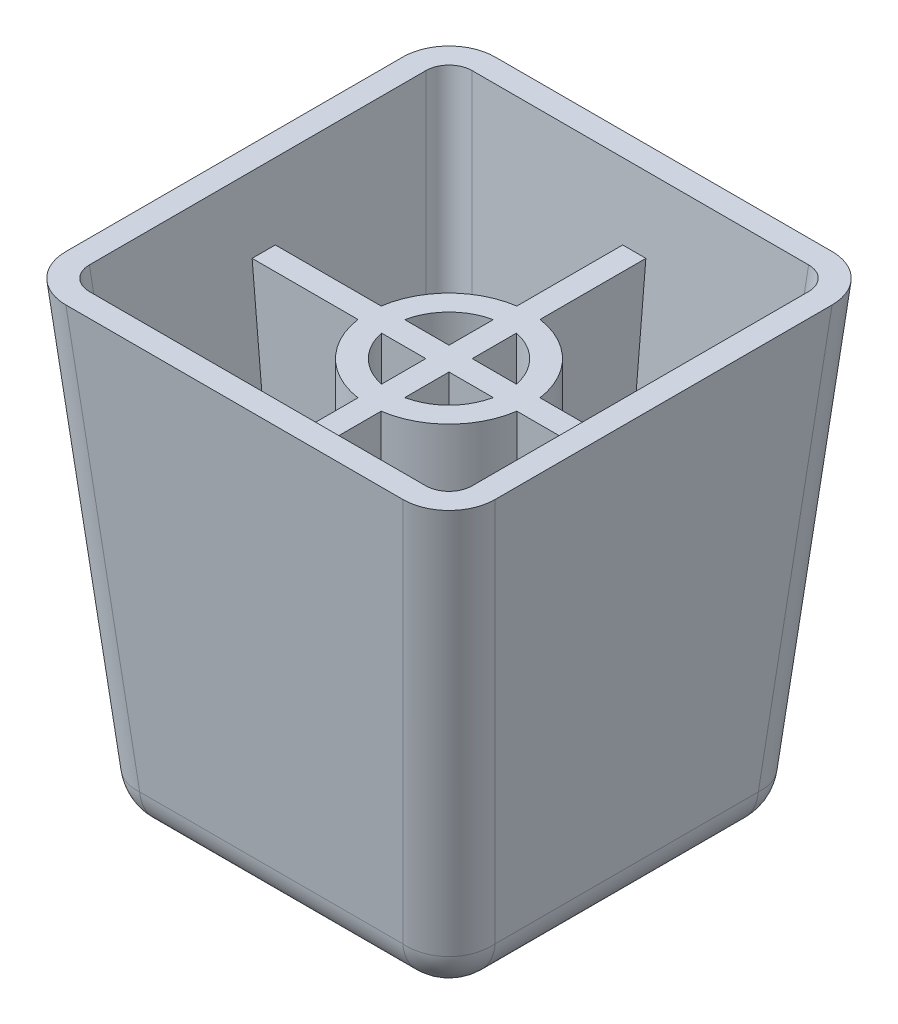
ISO-10303-21;
HEADER;
FILE_DESCRIPTION(('STEP AP214'),'2;1');
FILE_NAME('part.step','',(''),(''),'','','');
FILE_SCHEMA(('AUTOMOTIVE_DESIGN { 1 0 10303 214 1 1 1 1 }'));
ENDSEC;
DATA;
#1=APPLICATION_CONTEXT('core data for automotive mechanical design processes');
#2=APPLICATION_PROTOCOL_DEFINITION('international standard','automotive_design',2000,#1);
#3=PRODUCT_CONTEXT('',#1,'mechanical');
#4=PRODUCT('Part','Part','',(#3));
#5=PRODUCT_RELATED_PRODUCT_CATEGORY('part','',(#4));
#6=PRODUCT_DEFINITION_FORMATION('','',#4);
#7=PRODUCT_DEFINITION_CONTEXT('part definition',#1,'design');
#8=PRODUCT_DEFINITION('design','',#6,#7);
#9=PRODUCT_DEFINITION_SHAPE('','',#8);
#10=(LENGTH_UNIT() NAMED_UNIT(*) SI_UNIT(.MILLI.,.METRE.));
#11=(NAMED_UNIT(*) PLANE_ANGLE_UNIT() SI_UNIT($,.RADIAN.));
#12=(NAMED_UNIT(*) SI_UNIT($,.STERADIAN.) SOLID_ANGLE_UNIT());
#13=UNCERTAINTY_MEASURE_WITH_UNIT(LENGTH_MEASURE(1.E-05),#10,'distance_accuracy_value','');
#14=(GEOMETRIC_REPRESENTATION_CONTEXT(3) GLOBAL_UNCERTAINTY_ASSIGNED_CONTEXT((#13)) GLOBAL_UNIT_ASSIGNED_CONTEXT((#10,
#11,#12)) REPRESENTATION_CONTEXT('',''));
#15=CARTESIAN_POINT('',(0.,0.,0.));
#16=DIRECTION('',(0.,0.,1.));
#17=DIRECTION('',(1.,0.,0.));
#18=AXIS2_PLACEMENT_3D('',#15,#16,#17);
#19=CARTESIAN_POINT('',(37.5,5.,-37.5));
#20=DIRECTION('',(0.,1.,0.));
#21=DIRECTION('',(0.,0.,1.));
#22=AXIS2_PLACEMENT_3D('',#19,#20,#21);
#23=PLANE('',#22);
#24=DIRECTION('',(-1.,0.,0.));
#25=VECTOR('',#24,1.);
#26=CARTESIAN_POINT('',(37.5,5.,2.5));
#27=LINE('',#26,#25);
#28=CARTESIAN_POINT('',(28.3366882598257,5.,2.5));
#29=VERTEX_POINT('',#28);
#30=CARTESIAN_POINT('',(17.114079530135,5.,2.5));
#31=VERTEX_POINT('',#30);
#32=EDGE_CURVE('E460',#29,#31,#27,.T.);
#33=ORIENTED_EDGE('',*,*,#32,.T.);
#34=CARTESIAN_POINT('',(0.,5.,0.));
#35=DIRECTION('',(0.,1.,0.));
#36=DIRECTION('',(0.,0.,1.));
#37=AXIS2_PLACEMENT_3D('',#34,#35,#36);
#38=CIRCLE('',#37,17.2957138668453);
#39=CARTESIAN_POINT('',(2.5,5.,17.114079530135));
#40=VERTEX_POINT('',#39);
#41=EDGE_CURVE('E524',#31,#40,#38,.F.);
#42=ORIENTED_EDGE('',*,*,#41,.T.);
#43=DIRECTION('',(0.,0.,-1.));
#44=VECTOR('',#43,1.);
#45=CARTESIAN_POINT('',(2.5,5.,-37.5));
#46=LINE('',#45,#44);
#47=CARTESIAN_POINT('',(2.5,5.,28.3366882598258));
#48=VERTEX_POINT('',#47);
#49=EDGE_CURVE('E493',#48,#40,#46,.T.);
#50=ORIENTED_EDGE('',*,*,#49,.F.);
#51=DIRECTION('',(1.,0.,0.));
#52=VECTOR('',#51,1.);
#53=CARTESIAN_POINT('',(37.5,5.,28.3366882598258));
#54=LINE('',#53,#52);
#55=CARTESIAN_POINT('',(28.3366882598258,5.,28.3366882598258));
#56=VERTEX_POINT('',#55);
#57=EDGE_CURVE('E589',#56,#48,#54,.F.);
#58=ORIENTED_EDGE('',*,*,#57,.F.);
#59=DIRECTION('',(0.,0.,1.));
#60=VECTOR('',#59,1.);
#61=CARTESIAN_POINT('',(28.3366882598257,5.,-37.5));
#62=LINE('',#61,#60);
#63=EDGE_CURVE('E586',#29,#56,#62,.T.);
#64=ORIENTED_EDGE('',*,*,#63,.F.);
#65=EDGE_LOOP('',(#33,#42,#50,#58,#64));
#66=FACE_BOUND('',#65,.T.);
#67=ADVANCED_FACE('F39',(#66),#23,.T.);
#68=CARTESIAN_POINT('',(0.,85.,0.));
#69=DIRECTION('',(0.,-1.,0.));
#70=DIRECTION('',(0.,0.,-1.));
#71=AXIS2_PLACEMENT_3D('',#68,#69,#70);
#72=CYLINDRICAL_SURFACE('',#71,12.2957138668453);
#73=CARTESIAN_POINT('',(0.,5.,0.));
#74=DIRECTION('',(0.,1.,0.));
#75=DIRECTION('',(0.,0.,1.));
#76=AXIS2_PLACEMENT_3D('',#73,#74,#75);
#77=CIRCLE('',#76,12.2957138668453);
#78=CARTESIAN_POINT('',(-2.5,5.,12.038877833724));
#79=VERTEX_POINT('',#78);
#80=CARTESIAN_POINT('',(-12.038877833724,5.,2.5));
#81=VERTEX_POINT('',#80);
#82=EDGE_CURVE('E727',#79,#81,#77,.F.);
#83=ORIENTED_EDGE('',*,*,#82,.T.);
#84=DIRECTION('',(0.,-1.,0.));
#85=VECTOR('',#84,1.);
#86=CARTESIAN_POINT('',(-12.038877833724,85.,2.5));
#87=LINE('',#86,#85);
#88=CARTESIAN_POINT('',(-12.038877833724,85.,2.5));
#89=VERTEX_POINT('',#88);
#90=EDGE_CURVE('E404',#81,#89,#87,.F.);
#91=ORIENTED_EDGE('',*,*,#90,.T.);
#92=CARTESIAN_POINT('',(0.,85.,0.));
#93=DIRECTION('',(0.,-1.,0.));
#94=DIRECTION('',(0.,0.,-1.));
#95=AXIS2_PLACEMENT_3D('',#92,#93,#94);
#96=CIRCLE('',#95,12.2957138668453);
#97=CARTESIAN_POINT('',(-2.5,85.,12.038877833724));
#98=VERTEX_POINT('',#97);
#99=EDGE_CURVE('E395',#89,#98,#96,.F.);
#100=ORIENTED_EDGE('',*,*,#99,.T.);
#101=DIRECTION('',(0.,-1.,0.));
#102=VECTOR('',#101,1.);
#103=CARTESIAN_POINT('',(-2.5,85.,12.038877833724));
#104=LINE('',#103,#102);
#105=EDGE_CURVE('E374',#98,#79,#104,.T.);
#106=ORIENTED_EDGE('',*,*,#105,.T.);
#107=EDGE_LOOP('',(#83,#91,#100,#106));
#108=FACE_BOUND('',#107,.T.);
#109=ADVANCED_FACE('F889',(#108),#72,.F.);
#110=CARTESIAN_POINT('',(0.,85.,0.));
#111=DIRECTION('',(0.,-1.,0.));
#112=DIRECTION('',(0.,0.,-1.));
#113=AXIS2_PLACEMENT_3D('',#110,#111,#112);
#114=CYLINDRICAL_SURFACE('',#113,17.2957138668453);
#115=DIRECTION('',(0.,-1.,0.));
#116=VECTOR('',#115,1.);
#117=CARTESIAN_POINT('',(-17.114079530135,85.,2.5));
#118=LINE('',#117,#116);
#119=CARTESIAN_POINT('',(-17.114079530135,5.,2.5));
#120=VERTEX_POINT('',#119);
#121=CARTESIAN_POINT('',(-17.114079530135,85.,2.5));
#122=VERTEX_POINT('',#121);
#123=EDGE_CURVE('E416',#120,#122,#118,.F.);
#124=ORIENTED_EDGE('',*,*,#123,.F.);
#125=CARTESIAN_POINT('',(-2.5,5.,17.114079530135));
#126=VERTEX_POINT('',#125);
#127=EDGE_CURVE('E529',#126,#120,#38,.F.);
#128=ORIENTED_EDGE('',*,*,#127,.F.);
#129=DIRECTION('',(0.,-1.,0.));
#130=VECTOR('',#129,1.);
#131=CARTESIAN_POINT('',(-2.5,85.,17.114079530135));
#132=LINE('',#131,#130);
#133=CARTESIAN_POINT('',(-2.5,85.,17.114079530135));
#134=VERTEX_POINT('',#133);
#135=EDGE_CURVE('E481',#134,#126,#132,.T.);
#136=ORIENTED_EDGE('',*,*,#135,.F.);
#137=CARTESIAN_POINT('',(0.,85.,0.));
#138=DIRECTION('',(0.,-1.,0.));
#139=DIRECTION('',(0.,0.,-1.));
#140=AXIS2_PLACEMENT_3D('',#137,#138,#139);
#141=CIRCLE('',#140,17.2957138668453);
#142=EDGE_CURVE('E526',#122,#134,#141,.F.);
#143=ORIENTED_EDGE('',*,*,#142,.F.);
#144=EDGE_LOOP('',(#124,#128,#136,#143));
#145=FACE_BOUND('',#144,.T.);
#146=ADVANCED_FACE('F900',(#145),#114,.T.);
#147=DIRECTION('',(0.,0.,-1.));
#148=VECTOR('',#147,1.);
#149=CARTESIAN_POINT('',(-2.5,5.,-37.5));
#150=LINE('',#149,#148);
#151=CARTESIAN_POINT('',(-2.5,5.,2.5));
#152=VERTEX_POINT('',#151);
#153=EDGE_CURVE('E748',#79,#152,#150,.T.);
#154=ORIENTED_EDGE('',*,*,#153,.T.);
#155=DIRECTION('',(-1.,0.,0.));
#156=VECTOR('',#155,1.);
#157=CARTESIAN_POINT('',(37.5,5.,2.5));
#158=LINE('',#157,#156);
#159=EDGE_CURVE('E64',#152,#81,#158,.T.);
#160=ORIENTED_EDGE('',*,*,#159,.T.);
#161=ORIENTED_EDGE('',*,*,#82,.F.);
#162=EDGE_LOOP('',(#154,#160,#161));
#163=FACE_BOUND('',#162,.T.);
#164=ADVANCED_FACE('F891',(#163),#23,.T.);
#165=DIRECTION('',(0.,0.,1.));
#166=VECTOR('',#165,1.);
#167=CARTESIAN_POINT('',(-28.3366882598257,5.,-37.5));
#168=LINE('',#167,#166);
#169=CARTESIAN_POINT('',(-28.3366882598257,5.,-2.5));
#170=VERTEX_POINT('',#169);
#171=CARTESIAN_POINT('',(-28.3366882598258,5.,-28.3366882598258));
#172=VERTEX_POINT('',#171);
#173=EDGE_CURVE('E583',#170,#172,#168,.F.);
#174=ORIENTED_EDGE('',*,*,#173,.F.);
#175=DIRECTION('',(1.,0.,0.));
#176=VECTOR('',#175,1.);
#177=CARTESIAN_POINT('',(37.5,5.,-2.5));
#178=LINE('',#177,#176);
#179=CARTESIAN_POINT('',(-17.114079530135,5.,-2.5));
#180=VERTEX_POINT('',#179);
#181=EDGE_CURVE('E452',#170,#180,#178,.T.);
#182=ORIENTED_EDGE('',*,*,#181,.T.);
#183=CARTESIAN_POINT('',(-2.5,5.,-17.114079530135));
#184=VERTEX_POINT('',#183);
#185=EDGE_CURVE('E534',#180,#184,#38,.F.);
#186=ORIENTED_EDGE('',*,*,#185,.T.);
#187=DIRECTION('',(0.,0.,-1.));
#188=VECTOR('',#187,1.);
#189=CARTESIAN_POINT('',(-2.5,5.,-37.5));
#190=LINE('',#189,#188);
#191=CARTESIAN_POINT('',(-2.5,5.,-28.3366882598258));
#192=VERTEX_POINT('',#191);
#193=EDGE_CURVE('E479',#184,#192,#190,.T.);
#194=ORIENTED_EDGE('',*,*,#193,.T.);
#195=DIRECTION('',(1.,0.,0.));
#196=VECTOR('',#195,1.);
#197=CARTESIAN_POINT('',(37.5,5.,-28.3366882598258));
#198=LINE('',#197,#196);
#199=EDGE_CURVE('E569',#172,#192,#198,.T.);
#200=ORIENTED_EDGE('',*,*,#199,.F.);
#201=EDGE_LOOP('',(#174,#182,#186,#194,#200));
#202=FACE_BOUND('',#201,.T.);
#203=ADVANCED_FACE('F879',(#202),#23,.T.);
#204=CARTESIAN_POINT('',(-32.5190265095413,0.435778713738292,-37.5));
#205=DIRECTION('',(-0.996194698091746,-0.0871557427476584,0.));
#206=DIRECTION('',(0.0871557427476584,-0.996194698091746,0.));
#207=AXIS2_PLACEMENT_3D('',#204,#205,#206);
#208=PLANE('',#207);
#209=DIRECTION('',(0.,0.,-1.));
#210=VECTOR('',#209,1.);
#211=CARTESIAN_POINT('',(-39.9174372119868,85.,-37.5));
#212=LINE('',#211,#210);
#213=CARTESIAN_POINT('',(-39.9174372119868,85.,-2.5));
#214=VERTEX_POINT('',#213);
#215=CARTESIAN_POINT('',(-39.9174372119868,85.,2.5));
#216=VERTEX_POINT('',#215);
#217=EDGE_CURVE('E445',#214,#216,#212,.F.);
#218=ORIENTED_EDGE('',*,*,#217,.F.);
#219=DIRECTION('',(-0.0871557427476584,0.996194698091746,0.));
#220=VECTOR('',#219,1.);
#221=CARTESIAN_POINT('',(-32.5190265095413,0.435778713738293,-2.5));
#222=LINE('',#221,#220);
#223=CARTESIAN_POINT('',(-33.3176617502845,9.56422128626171,-2.5));
#224=VERTEX_POINT('',#223);
#225=EDGE_CURVE('E451',#214,#224,#222,.F.);
#226=ORIENTED_EDGE('',*,*,#225,.T.);
#227=DIRECTION('',(0.,0.,1.));
#228=VECTOR('',#227,1.);
#229=CARTESIAN_POINT('',(-33.3176617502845,9.56422128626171,-37.5));
#230=LINE('',#229,#228);
#231=CARTESIAN_POINT('',(-33.3176617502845,9.56422128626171,-28.3366882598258));
#232=VERTEX_POINT('',#231);
#233=EDGE_CURVE('E556',#232,#224,#230,.T.);
#234=ORIENTED_EDGE('',*,*,#233,.F.);
#235=DIRECTION('',(0.0868265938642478,-0.992432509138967,0.0868265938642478));
#236=VECTOR('',#235,1.);
#237=CARTESIAN_POINT('',(-32.5941282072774,1.29419504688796,-27.6131547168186));
#238=LINE('',#237,#236);
#239=CARTESIAN_POINT('',(-41.2297671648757,100.,-36.2487936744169));
#240=VERTEX_POINT('',#239);
#241=EDGE_CURVE('E570',#240,#232,#238,.T.);
#242=ORIENTED_EDGE('',*,*,#241,.F.);
#243=DIRECTION('',(0.,0.,-1.));
#244=VECTOR('',#243,1.);
#245=CARTESIAN_POINT('',(-41.2297671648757,100.,-37.5));
#246=LINE('',#245,#244);
#247=CARTESIAN_POINT('',(-41.2297671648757,100.,36.248793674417));
#248=VERTEX_POINT('',#247);
#249=EDGE_CURVE('E629',#240,#248,#246,.F.);
#250=ORIENTED_EDGE('',*,*,#249,.T.);
#251=DIRECTION('',(0.0868265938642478,-0.992432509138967,-0.0868265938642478));
#252=VECTOR('',#251,1.);
#253=CARTESIAN_POINT('',(-32.5941282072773,1.29419504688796,27.6131547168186));
#254=LINE('',#253,#252);
#255=CARTESIAN_POINT('',(-33.3176617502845,9.56422128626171,28.3366882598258));
#256=VERTEX_POINT('',#255);
#257=EDGE_CURVE('E548',#256,#248,#254,.F.);
#258=ORIENTED_EDGE('',*,*,#257,.F.);
#259=CARTESIAN_POINT('',(-33.3176617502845,9.56422128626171,2.5));
#260=VERTEX_POINT('',#259);
#261=EDGE_CURVE('E567',#260,#256,#230,.T.);
#262=ORIENTED_EDGE('',*,*,#261,.F.);
#263=DIRECTION('',(-0.0871557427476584,0.996194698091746,0.));
#264=VECTOR('',#263,1.);
#265=CARTESIAN_POINT('',(-32.5190265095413,0.435778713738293,2.5));
#266=LINE('',#265,#264);
#267=EDGE_CURVE('E448',#216,#260,#266,.F.);
#268=ORIENTED_EDGE('',*,*,#267,.F.);
#269=EDGE_LOOP('',(#218,#226,#234,#242,#250,#258,#262,#268));
#270=FACE_BOUND('',#269,.T.);
#271=ADVANCED_FACE('F867',(#270),#208,.F.);
#272=CARTESIAN_POINT('',(28.3366882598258,10.,37.5));
#273=DIRECTION('',(0.,0.,1.));
#274=DIRECTION('',(1.,0.,0.));
#275=AXIS2_PLACEMENT_3D('',#272,#273,#274);
#276=CYLINDRICAL_SURFACE('',#275,5.);
#277=CARTESIAN_POINT('',(28.3366882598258,10.,2.5));
#278=DIRECTION('',(0.,0.,-1.));
#279=DIRECTION('',(-1.,0.,0.));
#280=AXIS2_PLACEMENT_3D('',#277,#278,#279);
#281=CIRCLE('',#280,5.);
#282=CARTESIAN_POINT('',(33.3176617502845,9.56422128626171,2.5));
#283=VERTEX_POINT('',#282);
#284=EDGE_CURVE('E48',#29,#283,#281,.F.);
#285=ORIENTED_EDGE('',*,*,#284,.F.);
#286=ORIENTED_EDGE('',*,*,#63,.T.);
#287=CARTESIAN_POINT('',(28.3366882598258,10.,28.3366882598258));
#288=DIRECTION('',(0.,0.,1.));
#289=DIRECTION('',(1.,0.,0.));
#290=AXIS2_PLACEMENT_3D('',#287,#288,#289);
#291=CIRCLE('',#290,5.);
#292=CARTESIAN_POINT('',(33.3176617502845,9.56422128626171,28.3366882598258));
#293=VERTEX_POINT('',#292);
#294=EDGE_CURVE('E575',#293,#56,#291,.F.);
#295=ORIENTED_EDGE('',*,*,#294,.F.);
#296=DIRECTION('',(0.,0.,1.));
#297=VECTOR('',#296,1.);
#298=CARTESIAN_POINT('',(33.3176617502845,9.56422128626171,37.5));
#299=LINE('',#298,#297);
#300=EDGE_CURVE('E537',#293,#283,#299,.F.);
#301=ORIENTED_EDGE('',*,*,#300,.T.);
#302=EDGE_LOOP('',(#285,#286,#295,#301));
#303=FACE_BOUND('',#302,.T.);
#304=ADVANCED_FACE('F866',(#303),#276,.F.);
#305=CARTESIAN_POINT('',(-28.3366882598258,10.,-37.5));
#306=DIRECTION('',(0.,0.,-1.));
#307=DIRECTION('',(-1.,0.,0.));
#308=AXIS2_PLACEMENT_3D('',#305,#306,#307);
#309=CYLINDRICAL_SURFACE('',#308,5.);
#310=CARTESIAN_POINT('',(-28.3366882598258,10.,-2.5));
#311=DIRECTION('',(0.,0.,1.));
#312=DIRECTION('',(1.,0.,0.));
#313=AXIS2_PLACEMENT_3D('',#310,#311,#312);
#314=CIRCLE('',#313,5.);
#315=EDGE_CURVE('E749',#170,#224,#314,.F.);
#316=ORIENTED_EDGE('',*,*,#315,.F.);
#317=ORIENTED_EDGE('',*,*,#173,.T.);
#318=CARTESIAN_POINT('',(-28.3366882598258,10.,-28.3366882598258));
#319=DIRECTION('',(0.,0.,1.));
#320=DIRECTION('',(1.,0.,0.));
#321=AXIS2_PLACEMENT_3D('',#318,#319,#320);
#322=CIRCLE('',#321,5.);
#323=EDGE_CURVE('E611',#172,#232,#322,.F.);
#324=ORIENTED_EDGE('',*,*,#323,.T.);
#325=ORIENTED_EDGE('',*,*,#233,.T.);
#326=EDGE_LOOP('',(#316,#317,#324,#325));
#327=FACE_BOUND('',#326,.T.);
#328=ADVANCED_FACE('F868',(#327),#309,.F.);
#329=CARTESIAN_POINT('',(2.5,85.,12.038877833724));
#330=VERTEX_POINT('',#329);
#331=CARTESIAN_POINT('',(12.038877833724,85.,2.5));
#332=VERTEX_POINT('',#331);
#333=EDGE_CURVE('E522',#330,#332,#96,.F.);
#334=ORIENTED_EDGE('',*,*,#333,.T.);
#335=DIRECTION('',(0.,-1.,0.));
#336=VECTOR('',#335,1.);
#337=CARTESIAN_POINT('',(12.038877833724,85.,2.5));
#338=LINE('',#337,#336);
#339=CARTESIAN_POINT('',(12.038877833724,5.,2.5));
#340=VERTEX_POINT('',#339);
#341=EDGE_CURVE('E413',#332,#340,#338,.T.);
#342=ORIENTED_EDGE('',*,*,#341,.T.);
#343=CARTESIAN_POINT('',(2.5,5.,12.038877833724));
#344=VERTEX_POINT('',#343);
#345=EDGE_CURVE('E691',#340,#344,#77,.F.);
#346=ORIENTED_EDGE('',*,*,#345,.T.);
#347=DIRECTION('',(0.,-1.,0.));
#348=VECTOR('',#347,1.);
#349=CARTESIAN_POINT('',(2.5,85.,12.038877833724));
#350=LINE('',#349,#348);
#351=EDGE_CURVE('E490',#330,#344,#350,.T.);
#352=ORIENTED_EDGE('',*,*,#351,.F.);
#353=EDGE_LOOP('',(#334,#342,#346,#352));
#354=FACE_BOUND('',#353,.T.);
#355=ADVANCED_FACE('F876',(#354),#72,.F.);
#356=DIRECTION('',(0.,-1.,0.));
#357=VECTOR('',#356,1.);
#358=CARTESIAN_POINT('',(17.114079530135,85.,2.5));
#359=LINE('',#358,#357);
#360=CARTESIAN_POINT('',(17.114079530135,85.,2.5));
#361=VERTEX_POINT('',#360);
#362=EDGE_CURVE('E412',#361,#31,#359,.T.);
#363=ORIENTED_EDGE('',*,*,#362,.F.);
#364=CARTESIAN_POINT('',(2.5,85.,17.114079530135));
#365=VERTEX_POINT('',#364);
#366=EDGE_CURVE('E530',#365,#361,#141,.F.);
#367=ORIENTED_EDGE('',*,*,#366,.F.);
#368=DIRECTION('',(0.,-1.,0.));
#369=VECTOR('',#368,1.);
#370=CARTESIAN_POINT('',(2.5,85.,17.114079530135));
#371=LINE('',#370,#369);
#372=EDGE_CURVE('E492',#365,#40,#371,.T.);
#373=ORIENTED_EDGE('',*,*,#372,.T.);
#374=ORIENTED_EDGE('',*,*,#41,.F.);
#375=EDGE_LOOP('',(#363,#367,#373,#374));
#376=FACE_BOUND('',#375,.T.);
#377=ADVANCED_FACE('F800',(#376),#114,.T.);
#378=ORIENTED_EDGE('',*,*,#345,.F.);
#379=DIRECTION('',(-1.,0.,0.));
#380=VECTOR('',#379,1.);
#381=CARTESIAN_POINT('',(37.5,5.,2.5));
#382=LINE('',#381,#380);
#383=CARTESIAN_POINT('',(2.5,5.,2.5));
#384=VERTEX_POINT('',#383);
#385=EDGE_CURVE('E407',#340,#384,#382,.T.);
#386=ORIENTED_EDGE('',*,*,#385,.T.);
#387=DIRECTION('',(0.,0.,-1.));
#388=VECTOR('',#387,1.);
#389=CARTESIAN_POINT('',(2.5,5.,-37.5));
#390=LINE('',#389,#388);
#391=EDGE_CURVE('E744',#344,#384,#390,.T.);
#392=ORIENTED_EDGE('',*,*,#391,.F.);
#393=EDGE_LOOP('',(#378,#386,#392));
#394=FACE_BOUND('',#393,.T.);
#395=ADVANCED_FACE('F988',(#394),#23,.T.);
#396=CARTESIAN_POINT('',(2.5,85.,-21.2661064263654));
#397=DIRECTION('',(1.,0.,0.));
#398=DIRECTION('',(0.,0.,-1.));
#399=AXIS2_PLACEMENT_3D('',#396,#397,#398);
#400=PLANE('',#399);
#401=ORIENTED_EDGE('',*,*,#391,.T.);
#402=DIRECTION('',(0.,1.,0.));
#403=VECTOR('',#402,1.);
#404=CARTESIAN_POINT('',(2.5,85.,2.5));
#405=LINE('',#404,#403);
#406=CARTESIAN_POINT('',(2.5,85.,2.5));
#407=VERTEX_POINT('',#406);
#408=EDGE_CURVE('E410',#384,#407,#405,.T.);
#409=ORIENTED_EDGE('',*,*,#408,.T.);
#410=DIRECTION('',(0.,0.,-1.));
#411=VECTOR('',#410,1.);
#412=CARTESIAN_POINT('',(2.5,85.,-21.2661064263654));
#413=LINE('',#412,#411);
#414=EDGE_CURVE('E462',#407,#330,#413,.F.);
#415=ORIENTED_EDGE('',*,*,#414,.T.);
#416=ORIENTED_EDGE('',*,*,#351,.T.);
#417=EDGE_LOOP('',(#401,#409,#415,#416));
#418=FACE_BOUND('',#417,.T.);
#419=ADVANCED_FACE('F978',(#418),#400,.T.);
#420=CARTESIAN_POINT('',(-2.5,85.,-21.2661064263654));
#421=DIRECTION('',(1.,0.,0.));
#422=DIRECTION('',(0.,0.,-1.));
#423=AXIS2_PLACEMENT_3D('',#420,#421,#422);
#424=PLANE('',#423);
#425=DIRECTION('',(0.,1.,0.));
#426=VECTOR('',#425,1.);
#427=CARTESIAN_POINT('',(-2.5,85.,2.5));
#428=LINE('',#427,#426);
#429=CARTESIAN_POINT('',(-2.5,85.,2.5));
#430=VERTEX_POINT('',#429);
#431=EDGE_CURVE('E43',#152,#430,#428,.T.);
#432=ORIENTED_EDGE('',*,*,#431,.F.);
#433=ORIENTED_EDGE('',*,*,#153,.F.);
#434=ORIENTED_EDGE('',*,*,#105,.F.);
#435=DIRECTION('',(0.,0.,-1.));
#436=VECTOR('',#435,1.);
#437=CARTESIAN_POINT('',(-2.5,85.,-21.2661064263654));
#438=LINE('',#437,#436);
#439=EDGE_CURVE('E371',#430,#98,#438,.F.);
#440=ORIENTED_EDGE('',*,*,#439,.F.);
#441=EDGE_LOOP('',(#432,#433,#434,#440));
#442=FACE_BOUND('',#441,.T.);
#443=ADVANCED_FACE('F373',(#442),#424,.F.);
#444=DIRECTION('',(-1.,0.,0.));
#445=VECTOR('',#444,1.);
#446=CARTESIAN_POINT('',(37.5,5.,-2.5));
#447=LINE('',#446,#445);
#448=CARTESIAN_POINT('',(28.3366882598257,5.,-2.5));
#449=VERTEX_POINT('',#448);
#450=CARTESIAN_POINT('',(17.114079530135,5.,-2.5));
#451=VERTEX_POINT('',#450);
#452=EDGE_CURVE('E436',#449,#451,#447,.T.);
#453=ORIENTED_EDGE('',*,*,#452,.F.);
#454=CARTESIAN_POINT('',(28.3366882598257,5.,-28.3366882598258));
#455=VERTEX_POINT('',#454);
#456=EDGE_CURVE('E585',#455,#449,#62,.T.);
#457=ORIENTED_EDGE('',*,*,#456,.F.);
#458=CARTESIAN_POINT('',(2.5,5.,-28.3366882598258));
#459=VERTEX_POINT('',#458);
#460=EDGE_CURVE('E576',#459,#455,#198,.T.);
#461=ORIENTED_EDGE('',*,*,#460,.F.);
#462=DIRECTION('',(0.,0.,1.));
#463=VECTOR('',#462,1.);
#464=CARTESIAN_POINT('',(2.5,5.,-37.5));
#465=LINE('',#464,#463);
#466=CARTESIAN_POINT('',(2.5,5.,-17.114079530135));
#467=VERTEX_POINT('',#466);
#468=EDGE_CURVE('E509',#459,#467,#465,.T.);
#469=ORIENTED_EDGE('',*,*,#468,.T.);
#470=EDGE_CURVE('E532',#467,#451,#38,.F.);
#471=ORIENTED_EDGE('',*,*,#470,.T.);
#472=EDGE_LOOP('',(#453,#457,#461,#469,#471));
#473=FACE_BOUND('',#472,.T.);
#474=ADVANCED_FACE('F855',(#473),#23,.T.);
#475=CARTESIAN_POINT('',(37.5,0.435778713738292,-32.5190265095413));
#476=DIRECTION('',(0.,-0.0871557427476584,-0.996194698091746));
#477=DIRECTION('',(0.,0.996194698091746,-0.0871557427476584));
#478=AXIS2_PLACEMENT_3D('',#475,#476,#477);
#479=PLANE('',#478);
#480=DIRECTION('',(1.,0.,0.));
#481=VECTOR('',#480,1.);
#482=CARTESIAN_POINT('',(37.5,85.,-39.9174372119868));
#483=LINE('',#482,#481);
#484=CARTESIAN_POINT('',(2.5,85.,-39.9174372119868));
#485=VERTEX_POINT('',#484);
#486=CARTESIAN_POINT('',(-2.5,85.,-39.9174372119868));
#487=VERTEX_POINT('',#486);
#488=EDGE_CURVE('E505',#485,#487,#483,.F.);
#489=ORIENTED_EDGE('',*,*,#488,.F.);
#490=DIRECTION('',(0.,0.996194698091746,-0.0871557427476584));
#491=VECTOR('',#490,1.);
#492=CARTESIAN_POINT('',(2.5,0.435778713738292,-32.5190265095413));
#493=LINE('',#492,#491);
#494=CARTESIAN_POINT('',(2.5,9.56422128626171,-33.3176617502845));
#495=VERTEX_POINT('',#494);
#496=EDGE_CURVE('E507',#485,#495,#493,.F.);
#497=ORIENTED_EDGE('',*,*,#496,.T.);
#498=DIRECTION('',(1.,0.,0.));
#499=VECTOR('',#498,1.);
#500=CARTESIAN_POINT('',(37.5,9.56422128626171,-33.3176617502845));
#501=LINE('',#500,#499);
#502=CARTESIAN_POINT('',(28.3366882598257,9.56422128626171,-33.3176617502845));
#503=VERTEX_POINT('',#502);
#504=EDGE_CURVE('E604',#503,#495,#501,.F.);
#505=ORIENTED_EDGE('',*,*,#504,.F.);
#506=DIRECTION('',(-0.0868265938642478,-0.992432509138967,0.0868265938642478));
#507=VECTOR('',#506,1.);
#508=CARTESIAN_POINT('',(27.6131547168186,1.29419504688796,-32.5941282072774));
#509=LINE('',#508,#507);
#510=CARTESIAN_POINT('',(36.2487936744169,100.,-41.2297671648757));
#511=VERTEX_POINT('',#510);
#512=EDGE_CURVE('E602',#511,#503,#509,.T.);
#513=ORIENTED_EDGE('',*,*,#512,.F.);
#514=DIRECTION('',(1.,0.,0.));
#515=VECTOR('',#514,1.);
#516=CARTESIAN_POINT('',(37.5,100.,-41.2297671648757));
#517=LINE('',#516,#515);
#518=CARTESIAN_POINT('',(-36.248793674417,100.,-41.2297671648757));
#519=VERTEX_POINT('',#518);
#520=EDGE_CURVE('E623',#511,#519,#517,.F.);
#521=ORIENTED_EDGE('',*,*,#520,.T.);
#522=DIRECTION('',(0.0868265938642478,-0.992432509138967,0.0868265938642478));
#523=VECTOR('',#522,1.);
#524=CARTESIAN_POINT('',(-27.6131547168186,1.29419504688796,-32.5941282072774));
#525=LINE('',#524,#523);
#526=CARTESIAN_POINT('',(-28.3366882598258,9.56422128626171,-33.3176617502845));
#527=VERTEX_POINT('',#526);
#528=EDGE_CURVE('E606',#527,#519,#525,.F.);
#529=ORIENTED_EDGE('',*,*,#528,.F.);
#530=CARTESIAN_POINT('',(-2.5,9.56422128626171,-33.3176617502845));
#531=VERTEX_POINT('',#530);
#532=EDGE_CURVE('E609',#531,#527,#501,.F.);
#533=ORIENTED_EDGE('',*,*,#532,.F.);
#534=DIRECTION('',(0.,0.996194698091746,-0.0871557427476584));
#535=VECTOR('',#534,1.);
#536=CARTESIAN_POINT('',(-2.5,0.435778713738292,-32.5190265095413));
#537=LINE('',#536,#535);
#538=EDGE_CURVE('E501',#487,#531,#537,.F.);
#539=ORIENTED_EDGE('',*,*,#538,.F.);
#540=EDGE_LOOP('',(#489,#497,#505,#513,#521,#529,#533,#539));
#541=FACE_BOUND('',#540,.T.);
#542=ADVANCED_FACE('F839',(#541),#479,.F.);
#543=CARTESIAN_POINT('',(-37.5,10.,28.3366882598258));
#544=DIRECTION('',(-1.,0.,0.));
#545=DIRECTION('',(0.,0.,1.));
#546=AXIS2_PLACEMENT_3D('',#543,#544,#545);
#547=CYLINDRICAL_SURFACE('',#546,5.);
#548=CARTESIAN_POINT('',(-2.5,10.,28.3366882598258));
#549=DIRECTION('',(1.,0.,0.));
#550=DIRECTION('',(0.,0.,-1.));
#551=AXIS2_PLACEMENT_3D('',#548,#549,#550);
#552=CIRCLE('',#551,5.);
#553=CARTESIAN_POINT('',(-2.5,5.,28.3366882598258));
#554=VERTEX_POINT('',#553);
#555=CARTESIAN_POINT('',(-2.5,9.56422128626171,33.3176617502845));
#556=VERTEX_POINT('',#555);
#557=EDGE_CURVE('E734',#554,#556,#552,.F.);
#558=ORIENTED_EDGE('',*,*,#557,.F.);
#559=CARTESIAN_POINT('',(-28.3366882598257,5.,28.3366882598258));
#560=VERTEX_POINT('',#559);
#561=EDGE_CURVE('E590',#554,#560,#54,.F.);
#562=ORIENTED_EDGE('',*,*,#561,.T.);
#563=CARTESIAN_POINT('',(-28.3366882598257,10.,28.3366882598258));
#564=DIRECTION('',(-1.,0.,0.));
#565=DIRECTION('',(0.,-1.,0.));
#566=AXIS2_PLACEMENT_3D('',#563,#564,#565);
#567=CIRCLE('',#566,5.);
#568=CARTESIAN_POINT('',(-28.3366882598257,9.56422128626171,33.3176617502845));
#569=VERTEX_POINT('',#568);
#570=EDGE_CURVE('E562',#560,#569,#567,.T.);
#571=ORIENTED_EDGE('',*,*,#570,.T.);
#572=DIRECTION('',(1.,0.,0.));
#573=VECTOR('',#572,1.);
#574=CARTESIAN_POINT('',(-37.5,9.56422128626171,33.3176617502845));
#575=LINE('',#574,#573);
#576=EDGE_CURVE('E557',#569,#556,#575,.T.);
#577=ORIENTED_EDGE('',*,*,#576,.T.);
#578=EDGE_LOOP('',(#558,#562,#571,#577));
#579=FACE_BOUND('',#578,.T.);
#580=ADVANCED_FACE('F947',(#579),#547,.F.);
#581=CARTESIAN_POINT('',(37.5,10.,-28.3366882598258));
#582=DIRECTION('',(1.,0.,0.));
#583=DIRECTION('',(0.,0.,-1.));
#584=AXIS2_PLACEMENT_3D('',#581,#582,#583);
#585=CYLINDRICAL_SURFACE('',#584,5.);
#586=CARTESIAN_POINT('',(2.5,10.,-28.3366882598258));
#587=DIRECTION('',(-1.,0.,0.));
#588=DIRECTION('',(0.,0.,1.));
#589=AXIS2_PLACEMENT_3D('',#586,#587,#588);
#590=CIRCLE('',#589,5.);
#591=EDGE_CURVE('E740',#459,#495,#590,.F.);
#592=ORIENTED_EDGE('',*,*,#591,.F.);
#593=ORIENTED_EDGE('',*,*,#460,.T.);
#594=CARTESIAN_POINT('',(28.3366882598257,10.,-28.3366882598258));
#595=DIRECTION('',(1.,0.,0.));
#596=DIRECTION('',(0.,0.,-1.));
#597=AXIS2_PLACEMENT_3D('',#594,#595,#596);
#598=CIRCLE('',#597,5.);
#599=EDGE_CURVE('E617',#503,#455,#598,.F.);
#600=ORIENTED_EDGE('',*,*,#599,.F.);
#601=ORIENTED_EDGE('',*,*,#504,.T.);
#602=EDGE_LOOP('',(#592,#593,#600,#601));
#603=FACE_BOUND('',#602,.T.);
#604=ADVANCED_FACE('F843',(#603),#585,.F.);
#605=DIRECTION('',(0.,-1.,0.));
#606=VECTOR('',#605,1.);
#607=CARTESIAN_POINT('',(-12.038877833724,85.,-2.5));
#608=LINE('',#607,#606);
#609=CARTESIAN_POINT('',(-12.038877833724,5.,-2.5));
#610=VERTEX_POINT('',#609);
#611=CARTESIAN_POINT('',(-12.038877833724,85.,-2.5));
#612=VERTEX_POINT('',#611);
#613=EDGE_CURVE('E57',#610,#612,#608,.F.);
#614=ORIENTED_EDGE('',*,*,#613,.F.);
#615=CARTESIAN_POINT('',(-2.5,5.,-12.038877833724));
#616=VERTEX_POINT('',#615);
#617=EDGE_CURVE('E732',#610,#616,#77,.F.);
#618=ORIENTED_EDGE('',*,*,#617,.T.);
#619=DIRECTION('',(0.,-1.,0.));
#620=VECTOR('',#619,1.);
#621=CARTESIAN_POINT('',(-2.5,85.,-12.038877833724));
#622=LINE('',#621,#620);
#623=CARTESIAN_POINT('',(-2.5,85.,-12.038877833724));
#624=VERTEX_POINT('',#623);
#625=EDGE_CURVE('E472',#616,#624,#622,.F.);
#626=ORIENTED_EDGE('',*,*,#625,.T.);
#627=EDGE_CURVE('E519',#624,#612,#96,.F.);
#628=ORIENTED_EDGE('',*,*,#627,.T.);
#629=EDGE_LOOP('',(#614,#618,#626,#628));
#630=FACE_BOUND('',#629,.T.);
#631=ADVANCED_FACE('F1094',(#630),#72,.F.);
#632=ORIENTED_EDGE('',*,*,#185,.F.);
#633=DIRECTION('',(0.,-1.,0.));
#634=VECTOR('',#633,1.);
#635=CARTESIAN_POINT('',(-17.114079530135,85.,-2.5));
#636=LINE('',#635,#634);
#637=CARTESIAN_POINT('',(-17.114079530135,85.,-2.5));
#638=VERTEX_POINT('',#637);
#639=EDGE_CURVE('E438',#180,#638,#636,.F.);
#640=ORIENTED_EDGE('',*,*,#639,.T.);
#641=CARTESIAN_POINT('',(-2.5,85.,-17.114079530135));
#642=VERTEX_POINT('',#641);
#643=EDGE_CURVE('E525',#642,#638,#141,.F.);
#644=ORIENTED_EDGE('',*,*,#643,.F.);
#645=DIRECTION('',(0.,-1.,0.));
#646=VECTOR('',#645,1.);
#647=CARTESIAN_POINT('',(-2.5,85.,-17.114079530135));
#648=LINE('',#647,#646);
#649=EDGE_CURVE('E478',#184,#642,#648,.F.);
#650=ORIENTED_EDGE('',*,*,#649,.F.);
#651=EDGE_LOOP('',(#632,#640,#644,#650));
#652=FACE_BOUND('',#651,.T.);
#653=ADVANCED_FACE('F787',(#652),#114,.T.);
#654=DIRECTION('',(-1.,0.,0.));
#655=VECTOR('',#654,1.);
#656=CARTESIAN_POINT('',(37.5,5.,-2.5));
#657=LINE('',#656,#655);
#658=CARTESIAN_POINT('',(-2.5,5.,-2.5));
#659=VERTEX_POINT('',#658);
#660=EDGE_CURVE('E423',#659,#610,#657,.T.);
#661=ORIENTED_EDGE('',*,*,#660,.F.);
#662=EDGE_CURVE('E729',#659,#616,#150,.T.);
#663=ORIENTED_EDGE('',*,*,#662,.T.);
#664=ORIENTED_EDGE('',*,*,#617,.F.);
#665=EDGE_LOOP('',(#661,#663,#664));
#666=FACE_BOUND('',#665,.T.);
#667=ADVANCED_FACE('F916',(#666),#23,.T.);
#668=DIRECTION('',(-1.,0.,0.));
#669=VECTOR('',#668,1.);
#670=CARTESIAN_POINT('',(37.5,5.,2.5));
#671=LINE('',#670,#669);
#672=CARTESIAN_POINT('',(-28.3366882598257,5.,2.5));
#673=VERTEX_POINT('',#672);
#674=EDGE_CURVE('E418',#120,#673,#671,.T.);
#675=ORIENTED_EDGE('',*,*,#674,.T.);
#676=EDGE_CURVE('E579',#560,#673,#168,.F.);
#677=ORIENTED_EDGE('',*,*,#676,.F.);
#678=ORIENTED_EDGE('',*,*,#561,.F.);
#679=DIRECTION('',(0.,0.,-1.));
#680=VECTOR('',#679,1.);
#681=CARTESIAN_POINT('',(-2.5,5.,-37.5));
#682=LINE('',#681,#680);
#683=EDGE_CURVE('E514',#554,#126,#682,.T.);
#684=ORIENTED_EDGE('',*,*,#683,.T.);
#685=ORIENTED_EDGE('',*,*,#127,.T.);
#686=EDGE_LOOP('',(#675,#677,#678,#684,#685));
#687=FACE_BOUND('',#686,.T.);
#688=ADVANCED_FACE('F909',(#687),#23,.T.);
#689=CARTESIAN_POINT('',(37.5,0.,37.5));
#690=DIRECTION('',(0.996194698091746,-0.0871557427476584,0.));
#691=DIRECTION('',(0.0871557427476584,0.996194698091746,0.));
#692=AXIS2_PLACEMENT_3D('',#689,#690,#691);
#693=PLANE('',#692);
#694=DIRECTION('',(0.,0.,-1.));
#695=VECTOR('',#694,1.);
#696=CARTESIAN_POINT('',(38.2986352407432,9.12844257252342,37.5));
#697=LINE('',#696,#695);
#698=CARTESIAN_POINT('',(38.2986352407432,9.12844257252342,28.3366882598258));
#699=VERTEX_POINT('',#698);
#700=CARTESIAN_POINT('',(38.2986352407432,9.12844257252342,-28.3366882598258));
#701=VERTEX_POINT('',#700);
#702=EDGE_CURVE('E683',#699,#701,#697,.T.);
#703=ORIENTED_EDGE('',*,*,#702,.T.);
#704=DIRECTION('',(0.0868265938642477,0.992432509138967,-0.0868265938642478));
#705=VECTOR('',#704,1.);
#706=CARTESIAN_POINT('',(37.009687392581,-5.60429874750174,-27.0477404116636));
#707=LINE('',#706,#705);
#708=CARTESIAN_POINT('',(46.2488663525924,100.,-36.286919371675));
#709=VERTEX_POINT('',#708);
#710=EDGE_CURVE('E679',#701,#709,#707,.T.);
#711=ORIENTED_EDGE('',*,*,#710,.T.);
#712=DIRECTION('',(0.,0.,1.));
#713=VECTOR('',#712,1.);
#714=CARTESIAN_POINT('',(46.2488663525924,100.,37.5));
#715=LINE('',#714,#713);
#716=CARTESIAN_POINT('',(46.2488663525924,100.,36.286919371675));
#717=VERTEX_POINT('',#716);
#718=EDGE_CURVE('E639',#717,#709,#715,.F.);
#719=ORIENTED_EDGE('',*,*,#718,.F.);
#720=DIRECTION('',(0.0868265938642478,0.992432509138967,0.0868265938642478));
#721=VECTOR('',#720,1.);
#722=CARTESIAN_POINT('',(37.5751016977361,0.858416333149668,27.6131547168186));
#723=LINE('',#722,#721);
#724=EDGE_CURVE('E681',#717,#699,#723,.F.);
#725=ORIENTED_EDGE('',*,*,#724,.T.);
#726=EDGE_LOOP('',(#703,#711,#719,#725));
#727=FACE_BOUND('',#726,.T.);
#728=ADVANCED_FACE('F920',(#727),#693,.T.);
#729=CARTESIAN_POINT('',(37.5,0.,-37.5));
#730=DIRECTION('',(0.,-0.0871557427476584,-0.996194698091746));
#731=DIRECTION('',(0.,0.996194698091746,-0.0871557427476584));
#732=AXIS2_PLACEMENT_3D('',#729,#730,#731);
#733=PLANE('',#732);
#734=DIRECTION('',(-1.,0.,0.));
#735=VECTOR('',#734,1.);
#736=CARTESIAN_POINT('',(37.5,9.12844257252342,-38.2986352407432));
#737=LINE('',#736,#735);
#738=CARTESIAN_POINT('',(28.3366882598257,9.12844257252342,-38.2986352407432));
#739=VERTEX_POINT('',#738);
#740=CARTESIAN_POINT('',(-28.3366882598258,9.12844257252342,-38.2986352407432));
#741=VERTEX_POINT('',#740);
#742=EDGE_CURVE('E654',#739,#741,#737,.T.);
#743=ORIENTED_EDGE('',*,*,#742,.T.);
#744=DIRECTION('',(-0.0868265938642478,0.992432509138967,-0.0868265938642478));
#745=VECTOR('',#744,1.);
#746=CARTESIAN_POINT('',(-27.0477404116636,-5.60429874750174,-37.009687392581));
#747=LINE('',#746,#745);
#748=CARTESIAN_POINT('',(-36.286919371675,100.,-46.2488663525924));
#749=VERTEX_POINT('',#748);
#750=EDGE_CURVE('E653',#741,#749,#747,.T.);
#751=ORIENTED_EDGE('',*,*,#750,.T.);
#752=DIRECTION('',(1.,0.,0.));
#753=VECTOR('',#752,1.);
#754=CARTESIAN_POINT('',(37.5,100.,-46.2488663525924));
#755=LINE('',#754,#753);
#756=CARTESIAN_POINT('',(36.2869193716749,100.,-46.2488663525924));
#757=VERTEX_POINT('',#756);
#758=EDGE_CURVE('E641',#757,#749,#755,.F.);
#759=ORIENTED_EDGE('',*,*,#758,.F.);
#760=DIRECTION('',(0.0868265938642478,0.992432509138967,-0.0868265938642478));
#761=VECTOR('',#760,1.);
#762=CARTESIAN_POINT('',(27.6131547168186,0.858416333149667,-37.5751016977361));
#763=LINE('',#762,#761);
#764=EDGE_CURVE('E660',#757,#739,#763,.F.);
#765=ORIENTED_EDGE('',*,*,#764,.T.);
#766=EDGE_LOOP('',(#743,#751,#759,#765));
#767=FACE_BOUND('',#766,.T.);
#768=ADVANCED_FACE('F922',(#767),#733,.T.);
#769=CARTESIAN_POINT('',(-37.5,0.,-37.5));
#770=DIRECTION('',(-0.996194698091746,-0.0871557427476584,0.));
#771=DIRECTION('',(0.0871557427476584,-0.996194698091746,0.));
#772=AXIS2_PLACEMENT_3D('',#769,#770,#771);
#773=PLANE('',#772);
#774=DIRECTION('',(0.,0.,1.));
#775=VECTOR('',#774,1.);
#776=CARTESIAN_POINT('',(-38.2986352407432,9.12844257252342,-37.5));
#777=LINE('',#776,#775);
#778=CARTESIAN_POINT('',(-38.2986352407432,9.12844257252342,-28.3366882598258));
#779=VERTEX_POINT('',#778);
#780=CARTESIAN_POINT('',(-38.2986352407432,9.12844257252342,28.3366882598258));
#781=VERTEX_POINT('',#780);
#782=EDGE_CURVE('E669',#779,#781,#777,.T.);
#783=ORIENTED_EDGE('',*,*,#782,.T.);
#784=DIRECTION('',(-0.0868265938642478,0.992432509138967,0.0868265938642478));
#785=VECTOR('',#784,1.);
#786=CARTESIAN_POINT('',(-37.009687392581,-5.60429874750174,27.0477404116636));
#787=LINE('',#786,#785);
#788=CARTESIAN_POINT('',(-46.2488663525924,100.,36.286919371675));
#789=VERTEX_POINT('',#788);
#790=EDGE_CURVE('E671',#781,#789,#787,.T.);
#791=ORIENTED_EDGE('',*,*,#790,.T.);
#792=DIRECTION('',(0.,0.,-1.));
#793=VECTOR('',#792,1.);
#794=CARTESIAN_POINT('',(-46.2488663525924,100.,-37.5));
#795=LINE('',#794,#793);
#796=CARTESIAN_POINT('',(-46.2488663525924,100.,-36.286919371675));
#797=VERTEX_POINT('',#796);
#798=EDGE_CURVE('E650',#797,#789,#795,.F.);
#799=ORIENTED_EDGE('',*,*,#798,.F.);
#800=DIRECTION('',(-0.0868265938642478,0.992432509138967,-0.0868265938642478));
#801=VECTOR('',#800,1.);
#802=CARTESIAN_POINT('',(-37.5751016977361,0.858416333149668,-27.6131547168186));
#803=LINE('',#802,#801);
#804=EDGE_CURVE('E670',#797,#779,#803,.F.);
#805=ORIENTED_EDGE('',*,*,#804,.T.);
#806=EDGE_LOOP('',(#783,#791,#799,#805));
#807=FACE_BOUND('',#806,.T.);
#808=ADVANCED_FACE('F1356',(#807),#773,.T.);
#809=CARTESIAN_POINT('',(-37.5,0.,37.5));
#810=DIRECTION('',(0.,-0.0871557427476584,0.996194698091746));
#811=DIRECTION('',(0.,-0.996194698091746,-0.0871557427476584));
#812=AXIS2_PLACEMENT_3D('',#809,#810,#811);
#813=PLANE('',#812);
#814=DIRECTION('',(1.,0.,0.));
#815=VECTOR('',#814,1.);
#816=CARTESIAN_POINT('',(-37.5,9.12844257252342,38.2986352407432));
#817=LINE('',#816,#815);
#818=CARTESIAN_POINT('',(-28.3366882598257,9.12844257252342,38.2986352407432));
#819=VERTEX_POINT('',#818);
#820=CARTESIAN_POINT('',(28.3366882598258,9.12844257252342,38.2986352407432));
#821=VERTEX_POINT('',#820);
#822=EDGE_CURVE('E674',#819,#821,#817,.T.);
#823=ORIENTED_EDGE('',*,*,#822,.T.);
#824=DIRECTION('',(0.0868265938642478,0.992432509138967,0.0868265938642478));
#825=VECTOR('',#824,1.);
#826=CARTESIAN_POINT('',(27.0477404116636,-5.60429874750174,37.0096873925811));
#827=LINE('',#826,#825);
#828=CARTESIAN_POINT('',(36.286919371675,100.,46.2488663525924));
#829=VERTEX_POINT('',#828);
#830=EDGE_CURVE('E672',#821,#829,#827,.T.);
#831=ORIENTED_EDGE('',*,*,#830,.T.);
#832=DIRECTION('',(-1.,0.,0.));
#833=VECTOR('',#832,1.);
#834=CARTESIAN_POINT('',(-37.5,100.,46.2488663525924));
#835=LINE('',#834,#833);
#836=CARTESIAN_POINT('',(-36.2869193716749,100.,46.2488663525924));
#837=VERTEX_POINT('',#836);
#838=EDGE_CURVE('E649',#837,#829,#835,.F.);
#839=ORIENTED_EDGE('',*,*,#838,.F.);
#840=DIRECTION('',(-0.0868265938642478,0.992432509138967,0.0868265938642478));
#841=VECTOR('',#840,1.);
#842=CARTESIAN_POINT('',(-27.6131547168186,0.858416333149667,37.5751016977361));
#843=LINE('',#842,#841);
#844=EDGE_CURVE('E680',#837,#819,#843,.F.);
#845=ORIENTED_EDGE('',*,*,#844,.T.);
#846=EDGE_LOOP('',(#823,#831,#839,#845));
#847=FACE_BOUND('',#846,.T.);
#848=ADVANCED_FACE('F1352',(#847),#813,.T.);
#849=CARTESIAN_POINT('',(37.5,100.,-37.5));
#850=DIRECTION('',(0.,1.,0.));
#851=DIRECTION('',(0.,0.,1.));
#852=AXIS2_PLACEMENT_3D('',#849,#850,#851);
#853=PLANE('',#852);
#854=ORIENTED_EDGE('',*,*,#249,.F.);
#855=CARTESIAN_POINT('',(-36.210667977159,100.,-36.2106679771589));
#856=DIRECTION('',(0.,1.,0.));
#857=DIRECTION('',(0.707106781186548,0.,0.707106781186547));
#858=AXIS2_PLACEMENT_3D('',#855,#856,#857);
#859=ELLIPSE('',#858,5.03812597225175,5.);
#860=EDGE_CURVE('E538',#519,#240,#859,.T.);
#861=ORIENTED_EDGE('',*,*,#860,.F.);
#862=ORIENTED_EDGE('',*,*,#520,.F.);
#863=CARTESIAN_POINT('',(36.2106679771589,100.,-36.2106679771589));
#864=DIRECTION('',(0.,1.,0.));
#865=DIRECTION('',(-0.707106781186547,0.,0.707106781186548));
#866=AXIS2_PLACEMENT_3D('',#863,#864,#865);
#867=ELLIPSE('',#866,5.03812597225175,5.);
#868=CARTESIAN_POINT('',(41.2297671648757,100.,-36.2487936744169));
#869=VERTEX_POINT('',#868);
#870=EDGE_CURVE('E628',#869,#511,#867,.T.);
#871=ORIENTED_EDGE('',*,*,#870,.F.);
#872=DIRECTION('',(0.,0.,1.));
#873=VECTOR('',#872,1.);
#874=CARTESIAN_POINT('',(41.2297671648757,100.,37.5));
#875=LINE('',#874,#873);
#876=CARTESIAN_POINT('',(41.2297671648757,100.,36.248793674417));
#877=VERTEX_POINT('',#876);
#878=EDGE_CURVE('E592',#877,#869,#875,.F.);
#879=ORIENTED_EDGE('',*,*,#878,.F.);
#880=CARTESIAN_POINT('',(36.210667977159,100.,36.2106679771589));
#881=DIRECTION('',(0.,1.,0.));
#882=DIRECTION('',(-0.707106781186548,0.,-0.707106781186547));
#883=AXIS2_PLACEMENT_3D('',#880,#881,#882);
#884=ELLIPSE('',#883,5.03812597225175,5.);
#885=CARTESIAN_POINT('',(36.248793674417,100.,41.2297671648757));
#886=VERTEX_POINT('',#885);
#887=EDGE_CURVE('E626',#886,#877,#884,.T.);
#888=ORIENTED_EDGE('',*,*,#887,.F.);
#889=DIRECTION('',(-1.,0.,0.));
#890=VECTOR('',#889,1.);
#891=CARTESIAN_POINT('',(-37.5,100.,41.2297671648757));
#892=LINE('',#891,#890);
#893=CARTESIAN_POINT('',(-36.2487936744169,100.,41.2297671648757));
#894=VERTEX_POINT('',#893);
#895=EDGE_CURVE('E615',#894,#886,#892,.F.);
#896=ORIENTED_EDGE('',*,*,#895,.F.);
#897=CARTESIAN_POINT('',(-36.2106679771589,100.,36.2106679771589));
#898=DIRECTION('',(0.,1.,0.));
#899=DIRECTION('',(0.707106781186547,0.,-0.707106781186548));
#900=AXIS2_PLACEMENT_3D('',#897,#898,#899);
#901=ELLIPSE('',#900,5.03812597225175,5.);
#902=EDGE_CURVE('E635',#248,#894,#901,.T.);
#903=ORIENTED_EDGE('',*,*,#902,.F.);
#904=EDGE_LOOP('',(#854,#861,#862,#871,#879,#888,#896,#903));
#905=FACE_BOUND('',#904,.T.);
#906=ORIENTED_EDGE('',*,*,#798,.T.);
#907=CARTESIAN_POINT('',(-36.2106679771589,100.,36.2106679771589));
#908=DIRECTION('',(0.,1.,0.));
#909=DIRECTION('',(0.707106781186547,0.,-0.707106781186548));
#910=AXIS2_PLACEMENT_3D('',#907,#908,#909);
#911=ELLIPSE('',#910,10.0762519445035,10.);
#912=EDGE_CURVE('E693',#789,#837,#911,.T.);
#913=ORIENTED_EDGE('',*,*,#912,.T.);
#914=ORIENTED_EDGE('',*,*,#838,.T.);
#915=CARTESIAN_POINT('',(36.210667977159,100.,36.2106679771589));
#916=DIRECTION('',(0.,1.,0.));
#917=DIRECTION('',(-0.707106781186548,0.,-0.707106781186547));
#918=AXIS2_PLACEMENT_3D('',#915,#916,#917);
#919=ELLIPSE('',#918,10.0762519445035,10.);
#920=EDGE_CURVE('E690',#829,#717,#919,.T.);
#921=ORIENTED_EDGE('',*,*,#920,.T.);
#922=ORIENTED_EDGE('',*,*,#718,.T.);
#923=CARTESIAN_POINT('',(36.2106679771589,100.,-36.2106679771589));
#924=DIRECTION('',(0.,1.,0.));
#925=DIRECTION('',(-0.707106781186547,0.,0.707106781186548));
#926=AXIS2_PLACEMENT_3D('',#923,#924,#925);
#927=ELLIPSE('',#926,10.0762519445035,10.);
#928=EDGE_CURVE('E689',#709,#757,#927,.T.);
#929=ORIENTED_EDGE('',*,*,#928,.T.);
#930=ORIENTED_EDGE('',*,*,#758,.T.);
#931=CARTESIAN_POINT('',(-36.210667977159,100.,-36.2106679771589));
#932=DIRECTION('',(0.,1.,0.));
#933=DIRECTION('',(0.707106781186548,0.,0.707106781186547));
#934=AXIS2_PLACEMENT_3D('',#931,#932,#933);
#935=ELLIPSE('',#934,10.0762519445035,10.);
#936=EDGE_CURVE('E684',#749,#797,#935,.T.);
#937=ORIENTED_EDGE('',*,*,#936,.T.);
#938=EDGE_LOOP('',(#906,#913,#914,#921,#922,#929,#930,#937));
#939=FACE_BOUND('',#938,.T.);
#940=ADVANCED_FACE('F828',(#905,#939),#853,.T.);
#941=CARTESIAN_POINT('',(37.5,0.,-37.5));
#942=DIRECTION('',(0.,1.,0.));
#943=DIRECTION('',(0.,0.,1.));
#944=AXIS2_PLACEMENT_3D('',#941,#942,#943);
#945=PLANE('',#944);
#946=DIRECTION('',(0.,0.,-1.));
#947=VECTOR('',#946,1.);
#948=CARTESIAN_POINT('',(-28.3366882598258,0.,-37.5));
#949=LINE('',#948,#947);
#950=CARTESIAN_POINT('',(-28.3366882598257,0.,28.3366882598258));
#951=VERTEX_POINT('',#950);
#952=CARTESIAN_POINT('',(-28.3366882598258,0.,-28.3366882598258));
#953=VERTEX_POINT('',#952);
#954=EDGE_CURVE('E664',#951,#953,#949,.T.);
#955=ORIENTED_EDGE('',*,*,#954,.T.);
#956=DIRECTION('',(1.,0.,0.));
#957=VECTOR('',#956,1.);
#958=CARTESIAN_POINT('',(37.5,0.,-28.3366882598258));
#959=LINE('',#958,#957);
#960=CARTESIAN_POINT('',(28.3366882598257,0.,-28.3366882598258));
#961=VERTEX_POINT('',#960);
#962=EDGE_CURVE('E663',#953,#961,#959,.T.);
#963=ORIENTED_EDGE('',*,*,#962,.T.);
#964=DIRECTION('',(0.,0.,1.));
#965=VECTOR('',#964,1.);
#966=CARTESIAN_POINT('',(28.3366882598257,0.,-37.5));
#967=LINE('',#966,#965);
#968=CARTESIAN_POINT('',(28.3366882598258,0.,28.3366882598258));
#969=VERTEX_POINT('',#968);
#970=EDGE_CURVE('E658',#961,#969,#967,.T.);
#971=ORIENTED_EDGE('',*,*,#970,.T.);
#972=DIRECTION('',(-1.,0.,0.));
#973=VECTOR('',#972,1.);
#974=CARTESIAN_POINT('',(37.5,0.,28.3366882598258));
#975=LINE('',#974,#973);
#976=EDGE_CURVE('E662',#969,#951,#975,.T.);
#977=ORIENTED_EDGE('',*,*,#976,.T.);
#978=EDGE_LOOP('',(#955,#963,#971,#977));
#979=FACE_BOUND('',#978,.T.);
#980=ADVANCED_FACE('F1339',(#979),#945,.F.);
#981=CARTESIAN_POINT('',(27.6131547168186,1.72997376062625,27.6131547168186));
#982=DIRECTION('',(-0.0868265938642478,-0.992432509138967,-0.0868265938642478));
#983=DIRECTION('',(0.996194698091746,-0.0871557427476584,0.));
#984=AXIS2_PLACEMENT_3D('',#981,#982,#983);
#985=CYLINDRICAL_SURFACE('',#984,10.);
#986=ORIENTED_EDGE('',*,*,#920,.F.);
#987=ORIENTED_EDGE('',*,*,#830,.F.);
#988=CARTESIAN_POINT('',(28.3366882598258,10.,28.3366882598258));
#989=DIRECTION('',(-0.0868265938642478,-0.992432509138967,-0.0868265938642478));
#990=DIRECTION('',(0.996194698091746,-0.0871557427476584,0.));
#991=AXIS2_PLACEMENT_3D('',#988,#989,#990);
#992=CIRCLE('',#991,10.);
#993=EDGE_CURVE('E723',#699,#821,#992,.T.);
#994=ORIENTED_EDGE('',*,*,#993,.F.);
#995=ORIENTED_EDGE('',*,*,#724,.F.);
#996=EDGE_LOOP('',(#986,#987,#994,#995));
#997=FACE_BOUND('',#996,.T.);
#998=ADVANCED_FACE('F41',(#997),#985,.T.);
#999=CARTESIAN_POINT('',(-27.6131547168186,1.72997376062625,27.6131547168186));
#1000=DIRECTION('',(0.0868265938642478,-0.992432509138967,-0.0868265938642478));
#1001=DIRECTION('',(0.,0.0871557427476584,-0.996194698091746));
#1002=AXIS2_PLACEMENT_3D('',#999,#1000,#1001);
#1003=CYLINDRICAL_SURFACE('',#1002,10.);
#1004=ORIENTED_EDGE('',*,*,#912,.F.);
#1005=ORIENTED_EDGE('',*,*,#790,.F.);
#1006=CARTESIAN_POINT('',(-28.3366882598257,10.,28.3366882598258));
#1007=DIRECTION('',(0.0868265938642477,-0.992432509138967,-0.0868265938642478));
#1008=DIRECTION('',(0.,0.0871557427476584,-0.996194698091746));
#1009=AXIS2_PLACEMENT_3D('',#1006,#1007,#1008);
#1010=CIRCLE('',#1009,10.);
#1011=EDGE_CURVE('E718',#819,#781,#1010,.T.);
#1012=ORIENTED_EDGE('',*,*,#1011,.F.);
#1013=ORIENTED_EDGE('',*,*,#844,.F.);
#1014=EDGE_LOOP('',(#1004,#1005,#1012,#1013));
#1015=FACE_BOUND('',#1014,.T.);
#1016=ADVANCED_FACE('F1323',(#1015),#1003,.T.);
#1017=CARTESIAN_POINT('',(-37.5,10.,28.3366882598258));
#1018=DIRECTION('',(-1.,0.,0.));
#1019=DIRECTION('',(0.,0.,1.));
#1020=AXIS2_PLACEMENT_3D('',#1017,#1018,#1019);
#1021=CYLINDRICAL_SURFACE('',#1020,10.);
#1022=CARTESIAN_POINT('',(28.3366882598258,10.,28.3366882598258));
#1023=DIRECTION('',(1.,0.,0.));
#1024=DIRECTION('',(0.,0.,-1.));
#1025=AXIS2_PLACEMENT_3D('',#1022,#1023,#1024);
#1026=CIRCLE('',#1025,10.);
#1027=EDGE_CURVE('E644',#821,#969,#1026,.T.);
#1028=ORIENTED_EDGE('',*,*,#1027,.F.);
#1029=ORIENTED_EDGE('',*,*,#822,.F.);
#1030=CARTESIAN_POINT('',(-28.3366882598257,10.,28.3366882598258));
#1031=DIRECTION('',(-1.,0.,0.));
#1032=DIRECTION('',(0.,0.,1.));
#1033=AXIS2_PLACEMENT_3D('',#1030,#1031,#1032);
#1034=CIRCLE('',#1033,10.);
#1035=EDGE_CURVE('E720',#951,#819,#1034,.T.);
#1036=ORIENTED_EDGE('',*,*,#1035,.F.);
#1037=ORIENTED_EDGE('',*,*,#976,.F.);
#1038=EDGE_LOOP('',(#1028,#1029,#1036,#1037));
#1039=FACE_BOUND('',#1038,.T.);
#1040=ADVANCED_FACE('F1320',(#1039),#1021,.T.);
#1041=CARTESIAN_POINT('',(28.3366882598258,10.,28.3366882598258));
#1042=DIRECTION('',(0.,0.,1.));
#1043=DIRECTION('',(1.,0.,0.));
#1044=AXIS2_PLACEMENT_3D('',#1041,#1042,#1043);
#1045=SPHERICAL_SURFACE('',#1044,10.);
#1046=ORIENTED_EDGE('',*,*,#993,.T.);
#1047=ORIENTED_EDGE('',*,*,#1027,.T.);
#1048=CARTESIAN_POINT('',(28.3366882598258,10.,28.3366882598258));
#1049=DIRECTION('',(0.,0.,1.));
#1050=DIRECTION('',(1.,0.,0.));
#1051=AXIS2_PLACEMENT_3D('',#1048,#1049,#1050);
#1052=CIRCLE('',#1051,10.);
#1053=EDGE_CURVE('E713',#699,#969,#1052,.F.);
#1054=ORIENTED_EDGE('',*,*,#1053,.F.);
#1055=EDGE_LOOP('',(#1046,#1047,#1054));
#1056=FACE_BOUND('',#1055,.T.);
#1057=ADVANCED_FACE('F1307',(#1056),#1045,.T.);
#1058=CARTESIAN_POINT('',(-28.3366882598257,10.,28.3366882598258));
#1059=DIRECTION('',(0.,0.,1.));
#1060=DIRECTION('',(1.,0.,0.));
#1061=AXIS2_PLACEMENT_3D('',#1058,#1059,#1060);
#1062=SPHERICAL_SURFACE('',#1061,10.);
#1063=ORIENTED_EDGE('',*,*,#1035,.T.);
#1064=ORIENTED_EDGE('',*,*,#1011,.T.);
#1065=CARTESIAN_POINT('',(-28.3366882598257,10.,28.3366882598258));
#1066=DIRECTION('',(0.,0.,1.));
#1067=DIRECTION('',(0.,-1.,0.));
#1068=AXIS2_PLACEMENT_3D('',#1065,#1066,#1067);
#1069=CIRCLE('',#1068,10.);
#1070=EDGE_CURVE('E711',#951,#781,#1069,.F.);
#1071=ORIENTED_EDGE('',*,*,#1070,.F.);
#1072=EDGE_LOOP('',(#1063,#1064,#1071));
#1073=FACE_BOUND('',#1072,.T.);
#1074=ADVANCED_FACE('F1303',(#1073),#1062,.T.);
#1075=CARTESIAN_POINT('',(28.3366882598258,10.,37.5));
#1076=DIRECTION('',(0.,0.,1.));
#1077=DIRECTION('',(1.,0.,0.));
#1078=AXIS2_PLACEMENT_3D('',#1075,#1076,#1077);
#1079=CYLINDRICAL_SURFACE('',#1078,10.);
#1080=CARTESIAN_POINT('',(28.3366882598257,10.,-28.3366882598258));
#1081=DIRECTION('',(0.,0.,-1.));
#1082=DIRECTION('',(0.,1.,0.));
#1083=AXIS2_PLACEMENT_3D('',#1080,#1081,#1082);
#1084=CIRCLE('',#1083,10.);
#1085=EDGE_CURVE('E708',#701,#961,#1084,.T.);
#1086=ORIENTED_EDGE('',*,*,#1085,.F.);
#1087=ORIENTED_EDGE('',*,*,#702,.F.);
#1088=ORIENTED_EDGE('',*,*,#1053,.T.);
#1089=ORIENTED_EDGE('',*,*,#970,.F.);
#1090=EDGE_LOOP('',(#1086,#1087,#1088,#1089));
#1091=FACE_BOUND('',#1090,.T.);
#1092=ADVANCED_FACE('F1292',(#1091),#1079,.T.);
#1093=CARTESIAN_POINT('',(27.6131547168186,1.72997376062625,-27.6131547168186));
#1094=DIRECTION('',(-0.0868265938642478,-0.992432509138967,0.0868265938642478));
#1095=DIRECTION('',(0.,-0.0871557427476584,-0.996194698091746));
#1096=AXIS2_PLACEMENT_3D('',#1093,#1094,#1095);
#1097=CYLINDRICAL_SURFACE('',#1096,10.);
#1098=ORIENTED_EDGE('',*,*,#928,.F.);
#1099=ORIENTED_EDGE('',*,*,#710,.F.);
#1100=CARTESIAN_POINT('',(28.3366882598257,10.,-28.3366882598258));
#1101=DIRECTION('',(-0.0868265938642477,-0.992432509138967,0.0868265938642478));
#1102=DIRECTION('',(0.,-0.0871557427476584,-0.996194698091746));
#1103=AXIS2_PLACEMENT_3D('',#1100,#1101,#1102);
#1104=CIRCLE('',#1103,10.);
#1105=EDGE_CURVE('E704',#739,#701,#1104,.T.);
#1106=ORIENTED_EDGE('',*,*,#1105,.F.);
#1107=ORIENTED_EDGE('',*,*,#764,.F.);
#1108=EDGE_LOOP('',(#1098,#1099,#1106,#1107));
#1109=FACE_BOUND('',#1108,.T.);
#1110=ADVANCED_FACE('F1283',(#1109),#1097,.T.);
#1111=CARTESIAN_POINT('',(-27.6131547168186,1.72997376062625,-27.6131547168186));
#1112=DIRECTION('',(0.0868265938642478,-0.992432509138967,0.0868265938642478));
#1113=DIRECTION('',(0.996194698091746,0.0871557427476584,0.));
#1114=AXIS2_PLACEMENT_3D('',#1111,#1112,#1113);
#1115=CYLINDRICAL_SURFACE('',#1114,10.);
#1116=ORIENTED_EDGE('',*,*,#936,.F.);
#1117=ORIENTED_EDGE('',*,*,#750,.F.);
#1118=CARTESIAN_POINT('',(-28.3366882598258,10.,-28.3366882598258));
#1119=DIRECTION('',(0.0868265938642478,-0.992432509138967,0.0868265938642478));
#1120=DIRECTION('',(0.,-0.0871557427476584,-0.996194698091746));
#1121=AXIS2_PLACEMENT_3D('',#1118,#1119,#1120);
#1122=CIRCLE('',#1121,10.);
#1123=EDGE_CURVE('E705',#779,#741,#1122,.T.);
#1124=ORIENTED_EDGE('',*,*,#1123,.F.);
#1125=ORIENTED_EDGE('',*,*,#804,.F.);
#1126=EDGE_LOOP('',(#1116,#1117,#1124,#1125));
#1127=FACE_BOUND('',#1126,.T.);
#1128=ADVANCED_FACE('F1280',(#1127),#1115,.T.);
#1129=CARTESIAN_POINT('',(-28.3366882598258,10.,-37.5));
#1130=DIRECTION('',(0.,0.,-1.));
#1131=DIRECTION('',(-1.,0.,0.));
#1132=AXIS2_PLACEMENT_3D('',#1129,#1130,#1131);
#1133=CYLINDRICAL_SURFACE('',#1132,10.);
#1134=ORIENTED_EDGE('',*,*,#1070,.T.);
#1135=ORIENTED_EDGE('',*,*,#782,.F.);
#1136=CARTESIAN_POINT('',(-28.3366882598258,10.,-28.3366882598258));
#1137=DIRECTION('',(0.,0.,-1.));
#1138=DIRECTION('',(-1.,0.,0.));
#1139=AXIS2_PLACEMENT_3D('',#1136,#1137,#1138);
#1140=CIRCLE('',#1139,10.);
#1141=EDGE_CURVE('E699',#953,#779,#1140,.T.);
#1142=ORIENTED_EDGE('',*,*,#1141,.F.);
#1143=ORIENTED_EDGE('',*,*,#954,.F.);
#1144=EDGE_LOOP('',(#1134,#1135,#1142,#1143));
#1145=FACE_BOUND('',#1144,.T.);
#1146=ADVANCED_FACE('F1266',(#1145),#1133,.T.);
#1147=CARTESIAN_POINT('',(28.3366882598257,10.,-28.3366882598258));
#1148=DIRECTION('',(0.,0.,1.));
#1149=DIRECTION('',(1.,0.,0.));
#1150=AXIS2_PLACEMENT_3D('',#1147,#1148,#1149);
#1151=SPHERICAL_SURFACE('',#1150,10.);
#1152=ORIENTED_EDGE('',*,*,#1105,.T.);
#1153=ORIENTED_EDGE('',*,*,#1085,.T.);
#1154=CARTESIAN_POINT('',(28.3366882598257,10.,-28.3366882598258));
#1155=DIRECTION('',(1.,0.,0.));
#1156=DIRECTION('',(0.,0.,-1.));
#1157=AXIS2_PLACEMENT_3D('',#1154,#1155,#1156);
#1158=CIRCLE('',#1157,10.);
#1159=EDGE_CURVE('E698',#739,#961,#1158,.F.);
#1160=ORIENTED_EDGE('',*,*,#1159,.F.);
#1161=EDGE_LOOP('',(#1152,#1153,#1160));
#1162=FACE_BOUND('',#1161,.T.);
#1163=ADVANCED_FACE('F1261',(#1162),#1151,.T.);
#1164=CARTESIAN_POINT('',(-28.3366882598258,10.,-28.3366882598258));
#1165=DIRECTION('',(0.,0.,1.));
#1166=DIRECTION('',(1.,0.,0.));
#1167=AXIS2_PLACEMENT_3D('',#1164,#1165,#1166);
#1168=SPHERICAL_SURFACE('',#1167,10.);
#1169=ORIENTED_EDGE('',*,*,#1141,.T.);
#1170=ORIENTED_EDGE('',*,*,#1123,.T.);
#1171=CARTESIAN_POINT('',(-28.3366882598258,10.,-28.3366882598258));
#1172=DIRECTION('',(-1.,0.,0.));
#1173=DIRECTION('',(0.,-1.,0.));
#1174=AXIS2_PLACEMENT_3D('',#1171,#1172,#1173);
#1175=CIRCLE('',#1174,10.);
#1176=EDGE_CURVE('E638',#953,#741,#1175,.F.);
#1177=ORIENTED_EDGE('',*,*,#1176,.F.);
#1178=EDGE_LOOP('',(#1169,#1170,#1177));
#1179=FACE_BOUND('',#1178,.T.);
#1180=ADVANCED_FACE('F1255',(#1179),#1168,.T.);
#1181=CARTESIAN_POINT('',(37.5,10.,-28.3366882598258));
#1182=DIRECTION('',(1.,0.,0.));
#1183=DIRECTION('',(0.,0.,-1.));
#1184=AXIS2_PLACEMENT_3D('',#1181,#1182,#1183);
#1185=CYLINDRICAL_SURFACE('',#1184,10.);
#1186=ORIENTED_EDGE('',*,*,#1176,.T.);
#1187=ORIENTED_EDGE('',*,*,#742,.F.);
#1188=ORIENTED_EDGE('',*,*,#1159,.T.);
#1189=ORIENTED_EDGE('',*,*,#962,.F.);
#1190=EDGE_LOOP('',(#1186,#1187,#1188,#1189));
#1191=FACE_BOUND('',#1190,.T.);
#1192=ADVANCED_FACE('F1244',(#1191),#1185,.T.);
#1193=CARTESIAN_POINT('',(32.5190265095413,0.435778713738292,37.5));
#1194=DIRECTION('',(0.996194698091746,-0.0871557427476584,0.));
#1195=DIRECTION('',(0.0871557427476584,0.996194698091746,0.));
#1196=AXIS2_PLACEMENT_3D('',#1193,#1194,#1195);
#1197=PLANE('',#1196);
#1198=DIRECTION('',(0.0871557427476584,0.996194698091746,0.));
#1199=VECTOR('',#1198,1.);
#1200=CARTESIAN_POINT('',(32.5190265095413,0.435778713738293,-2.5));
#1201=LINE('',#1200,#1199);
#1202=CARTESIAN_POINT('',(39.9174372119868,85.,-2.5));
#1203=VERTEX_POINT('',#1202);
#1204=CARTESIAN_POINT('',(33.3176617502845,9.56422128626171,-2.5));
#1205=VERTEX_POINT('',#1204);
#1206=EDGE_CURVE('E459',#1203,#1205,#1201,.F.);
#1207=ORIENTED_EDGE('',*,*,#1206,.F.);
#1208=DIRECTION('',(0.,0.,1.));
#1209=VECTOR('',#1208,1.);
#1210=CARTESIAN_POINT('',(39.9174372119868,85.,37.5));
#1211=LINE('',#1210,#1209);
#1212=CARTESIAN_POINT('',(39.9174372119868,85.,2.5));
#1213=VERTEX_POINT('',#1212);
#1214=EDGE_CURVE('E443',#1213,#1203,#1211,.F.);
#1215=ORIENTED_EDGE('',*,*,#1214,.F.);
#1216=DIRECTION('',(0.0871557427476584,0.996194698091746,0.));
#1217=VECTOR('',#1216,1.);
#1218=CARTESIAN_POINT('',(32.5190265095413,0.435778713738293,2.5));
#1219=LINE('',#1218,#1217);
#1220=EDGE_CURVE('E454',#1213,#283,#1219,.F.);
#1221=ORIENTED_EDGE('',*,*,#1220,.T.);
#1222=ORIENTED_EDGE('',*,*,#300,.F.);
#1223=DIRECTION('',(-0.0868265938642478,-0.992432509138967,-0.0868265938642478));
#1224=VECTOR('',#1223,1.);
#1225=CARTESIAN_POINT('',(32.5941282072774,1.29419504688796,27.6131547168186));
#1226=LINE('',#1225,#1224);
#1227=EDGE_CURVE('E536',#877,#293,#1226,.T.);
#1228=ORIENTED_EDGE('',*,*,#1227,.F.);
#1229=ORIENTED_EDGE('',*,*,#878,.T.);
#1230=DIRECTION('',(-0.0868265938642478,-0.992432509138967,0.0868265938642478));
#1231=VECTOR('',#1230,1.);
#1232=CARTESIAN_POINT('',(32.5941282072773,1.29419504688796,-27.6131547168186));
#1233=LINE('',#1232,#1231);
#1234=CARTESIAN_POINT('',(33.3176617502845,9.56422128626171,-28.3366882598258));
#1235=VERTEX_POINT('',#1234);
#1236=EDGE_CURVE('E543',#1235,#869,#1233,.F.);
#1237=ORIENTED_EDGE('',*,*,#1236,.F.);
#1238=EDGE_CURVE('E545',#1205,#1235,#299,.F.);
#1239=ORIENTED_EDGE('',*,*,#1238,.F.);
#1240=EDGE_LOOP('',(#1207,#1215,#1221,#1222,#1228,#1229,#1237,#1239));
#1241=FACE_BOUND('',#1240,.T.);
#1242=ADVANCED_FACE('F824',(#1241),#1197,.F.);
#1243=CARTESIAN_POINT('',(-37.5,0.435778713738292,32.5190265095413));
#1244=DIRECTION('',(0.,-0.0871557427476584,0.996194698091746));
#1245=DIRECTION('',(0.,-0.996194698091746,-0.0871557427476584));
#1246=AXIS2_PLACEMENT_3D('',#1243,#1244,#1245);
#1247=PLANE('',#1246);
#1248=DIRECTION('',(0.,0.996194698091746,0.0871557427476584));
#1249=VECTOR('',#1248,1.);
#1250=CARTESIAN_POINT('',(2.5,0.435778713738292,32.5190265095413));
#1251=LINE('',#1250,#1249);
#1252=CARTESIAN_POINT('',(2.5,85.,39.9174372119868));
#1253=VERTEX_POINT('',#1252);
#1254=CARTESIAN_POINT('',(2.5,9.56422128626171,33.3176617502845));
#1255=VERTEX_POINT('',#1254);
#1256=EDGE_CURVE('E518',#1253,#1255,#1251,.F.);
#1257=ORIENTED_EDGE('',*,*,#1256,.F.);
#1258=DIRECTION('',(-1.,0.,0.));
#1259=VECTOR('',#1258,1.);
#1260=CARTESIAN_POINT('',(-37.5,85.,39.9174372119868));
#1261=LINE('',#1260,#1259);
#1262=CARTESIAN_POINT('',(-2.5,85.,39.9174372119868));
#1263=VERTEX_POINT('',#1262);
#1264=EDGE_CURVE('E500',#1263,#1253,#1261,.F.);
#1265=ORIENTED_EDGE('',*,*,#1264,.F.);
#1266=DIRECTION('',(0.,0.996194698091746,0.0871557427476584));
#1267=VECTOR('',#1266,1.);
#1268=CARTESIAN_POINT('',(-2.5,0.435778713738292,32.5190265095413));
#1269=LINE('',#1268,#1267);
#1270=EDGE_CURVE('E515',#1263,#556,#1269,.F.);
#1271=ORIENTED_EDGE('',*,*,#1270,.T.);
#1272=ORIENTED_EDGE('',*,*,#576,.F.);
#1273=DIRECTION('',(0.0868265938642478,-0.992432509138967,-0.0868265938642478));
#1274=VECTOR('',#1273,1.);
#1275=CARTESIAN_POINT('',(-27.6131547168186,1.29419504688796,32.5941282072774));
#1276=LINE('',#1275,#1274);
#1277=EDGE_CURVE('E544',#894,#569,#1276,.T.);
#1278=ORIENTED_EDGE('',*,*,#1277,.F.);
#1279=ORIENTED_EDGE('',*,*,#895,.T.);
#1280=DIRECTION('',(-0.0868265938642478,-0.992432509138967,-0.0868265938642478));
#1281=VECTOR('',#1280,1.);
#1282=CARTESIAN_POINT('',(27.6131547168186,1.29419504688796,32.5941282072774));
#1283=LINE('',#1282,#1281);
#1284=CARTESIAN_POINT('',(28.3366882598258,9.56422128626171,33.3176617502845));
#1285=VERTEX_POINT('',#1284);
#1286=EDGE_CURVE('E546',#1285,#886,#1283,.F.);
#1287=ORIENTED_EDGE('',*,*,#1286,.F.);
#1288=EDGE_CURVE('E547',#1255,#1285,#575,.T.);
#1289=ORIENTED_EDGE('',*,*,#1288,.F.);
#1290=EDGE_LOOP('',(#1257,#1265,#1271,#1272,#1278,#1279,#1287,#1289));
#1291=FACE_BOUND('',#1290,.T.);
#1292=ADVANCED_FACE('F807',(#1291),#1247,.F.);
#1293=CARTESIAN_POINT('',(27.6131547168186,1.72997376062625,27.6131547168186));
#1294=DIRECTION('',(-0.0868265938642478,-0.992432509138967,-0.0868265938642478));
#1295=DIRECTION('',(0.996194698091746,-0.0871557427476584,0.));
#1296=AXIS2_PLACEMENT_3D('',#1293,#1294,#1295);
#1297=CYLINDRICAL_SURFACE('',#1296,5.);
#1298=ORIENTED_EDGE('',*,*,#887,.T.);
#1299=ORIENTED_EDGE('',*,*,#1227,.T.);
#1300=CARTESIAN_POINT('',(28.3366882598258,10.,28.3366882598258));
#1301=DIRECTION('',(-0.0868265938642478,-0.992432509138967,-0.0868265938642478));
#1302=DIRECTION('',(0.996194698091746,-0.0871557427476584,0.));
#1303=AXIS2_PLACEMENT_3D('',#1300,#1301,#1302);
#1304=CIRCLE('',#1303,5.);
#1305=EDGE_CURVE('E549',#293,#1285,#1304,.T.);
#1306=ORIENTED_EDGE('',*,*,#1305,.T.);
#1307=ORIENTED_EDGE('',*,*,#1286,.T.);
#1308=EDGE_LOOP('',(#1298,#1299,#1306,#1307));
#1309=FACE_BOUND('',#1308,.T.);
#1310=ADVANCED_FACE('F819',(#1309),#1297,.F.);
#1311=CARTESIAN_POINT('',(-27.6131547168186,1.72997376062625,27.6131547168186));
#1312=DIRECTION('',(0.0868265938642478,-0.992432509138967,-0.0868265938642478));
#1313=DIRECTION('',(0.,0.0871557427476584,-0.996194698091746));
#1314=AXIS2_PLACEMENT_3D('',#1311,#1312,#1313);
#1315=CYLINDRICAL_SURFACE('',#1314,5.);
#1316=ORIENTED_EDGE('',*,*,#902,.T.);
#1317=ORIENTED_EDGE('',*,*,#1277,.T.);
#1318=CARTESIAN_POINT('',(-28.3366882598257,10.,28.3366882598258));
#1319=DIRECTION('',(0.0868265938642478,-0.992432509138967,-0.0868265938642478));
#1320=DIRECTION('',(0.,0.0871557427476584,-0.996194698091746));
#1321=AXIS2_PLACEMENT_3D('',#1318,#1319,#1320);
#1322=CIRCLE('',#1321,5.);
#1323=EDGE_CURVE('E551',#569,#256,#1322,.T.);
#1324=ORIENTED_EDGE('',*,*,#1323,.T.);
#1325=ORIENTED_EDGE('',*,*,#257,.T.);
#1326=EDGE_LOOP('',(#1316,#1317,#1324,#1325));
#1327=FACE_BOUND('',#1326,.T.);
#1328=ADVANCED_FACE('F943',(#1327),#1315,.F.);
#1329=ORIENTED_EDGE('',*,*,#57,.T.);
#1330=CARTESIAN_POINT('',(2.5,10.,28.3366882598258));
#1331=DIRECTION('',(1.,0.,0.));
#1332=DIRECTION('',(0.,0.,-1.));
#1333=AXIS2_PLACEMENT_3D('',#1330,#1331,#1332);
#1334=CIRCLE('',#1333,5.);
#1335=EDGE_CURVE('E386',#48,#1255,#1334,.F.);
#1336=ORIENTED_EDGE('',*,*,#1335,.T.);
#1337=ORIENTED_EDGE('',*,*,#1288,.T.);
#1338=CARTESIAN_POINT('',(28.3366882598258,10.,28.3366882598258));
#1339=DIRECTION('',(-1.,0.,0.));
#1340=DIRECTION('',(0.,-1.,0.));
#1341=AXIS2_PLACEMENT_3D('',#1338,#1339,#1340);
#1342=CIRCLE('',#1341,5.);
#1343=EDGE_CURVE('E554',#1285,#56,#1342,.F.);
#1344=ORIENTED_EDGE('',*,*,#1343,.T.);
#1345=EDGE_LOOP('',(#1329,#1336,#1337,#1344));
#1346=FACE_BOUND('',#1345,.T.);
#1347=ADVANCED_FACE('F810',(#1346),#547,.F.);
#1348=CARTESIAN_POINT('',(28.3366882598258,10.,28.3366882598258));
#1349=DIRECTION('',(0.,0.,1.));
#1350=DIRECTION('',(1.,0.,0.));
#1351=AXIS2_PLACEMENT_3D('',#1348,#1349,#1350);
#1352=SPHERICAL_SURFACE('',#1351,5.);
#1353=ORIENTED_EDGE('',*,*,#1305,.F.);
#1354=ORIENTED_EDGE('',*,*,#294,.T.);
#1355=ORIENTED_EDGE('',*,*,#1343,.F.);
#1356=EDGE_LOOP('',(#1353,#1354,#1355));
#1357=FACE_BOUND('',#1356,.T.);
#1358=ADVANCED_FACE('F818',(#1357),#1352,.F.);
#1359=CARTESIAN_POINT('',(-28.3366882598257,10.,28.3366882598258));
#1360=DIRECTION('',(0.,0.,1.));
#1361=DIRECTION('',(1.,0.,0.));
#1362=AXIS2_PLACEMENT_3D('',#1359,#1360,#1361);
#1363=SPHERICAL_SURFACE('',#1362,5.);
#1364=ORIENTED_EDGE('',*,*,#570,.F.);
#1365=CARTESIAN_POINT('',(-28.3366882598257,10.,28.3366882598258));
#1366=DIRECTION('',(0.,0.,-1.));
#1367=DIRECTION('',(-1.,0.,0.));
#1368=AXIS2_PLACEMENT_3D('',#1365,#1366,#1367);
#1369=CIRCLE('',#1368,5.);
#1370=EDGE_CURVE('E571',#560,#256,#1369,.T.);
#1371=ORIENTED_EDGE('',*,*,#1370,.T.);
#1372=ORIENTED_EDGE('',*,*,#1323,.F.);
#1373=EDGE_LOOP('',(#1364,#1371,#1372));
#1374=FACE_BOUND('',#1373,.T.);
#1375=ADVANCED_FACE('F887',(#1374),#1363,.F.);
#1376=ORIENTED_EDGE('',*,*,#456,.T.);
#1377=CARTESIAN_POINT('',(28.3366882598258,10.,-2.5));
#1378=DIRECTION('',(0.,0.,-1.));
#1379=DIRECTION('',(-1.,0.,0.));
#1380=AXIS2_PLACEMENT_3D('',#1377,#1378,#1379);
#1381=CIRCLE('',#1380,5.);
#1382=EDGE_CURVE('E11',#449,#1205,#1381,.F.);
#1383=ORIENTED_EDGE('',*,*,#1382,.T.);
#1384=ORIENTED_EDGE('',*,*,#1238,.T.);
#1385=CARTESIAN_POINT('',(28.3366882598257,10.,-28.3366882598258));
#1386=DIRECTION('',(0.,0.,1.));
#1387=DIRECTION('',(1.,0.,0.));
#1388=AXIS2_PLACEMENT_3D('',#1385,#1386,#1387);
#1389=CIRCLE('',#1388,5.);
#1390=EDGE_CURVE('E578',#1235,#455,#1389,.F.);
#1391=ORIENTED_EDGE('',*,*,#1390,.T.);
#1392=EDGE_LOOP('',(#1376,#1383,#1384,#1391));
#1393=FACE_BOUND('',#1392,.T.);
#1394=ADVANCED_FACE('F871',(#1393),#276,.F.);
#1395=CARTESIAN_POINT('',(27.6131547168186,1.72997376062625,-27.6131547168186));
#1396=DIRECTION('',(-0.0868265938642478,-0.992432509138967,0.0868265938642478));
#1397=DIRECTION('',(0.,-0.0871557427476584,-0.996194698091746));
#1398=AXIS2_PLACEMENT_3D('',#1395,#1396,#1397);
#1399=CYLINDRICAL_SURFACE('',#1398,5.);
#1400=ORIENTED_EDGE('',*,*,#870,.T.);
#1401=ORIENTED_EDGE('',*,*,#512,.T.);
#1402=CARTESIAN_POINT('',(28.3366882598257,10.,-28.3366882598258));
#1403=DIRECTION('',(-0.0868265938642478,-0.992432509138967,0.0868265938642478));
#1404=DIRECTION('',(0.,-0.0871557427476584,-0.996194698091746));
#1405=AXIS2_PLACEMENT_3D('',#1402,#1403,#1404);
#1406=CIRCLE('',#1405,5.);
#1407=EDGE_CURVE('E597',#503,#1235,#1406,.T.);
#1408=ORIENTED_EDGE('',*,*,#1407,.T.);
#1409=ORIENTED_EDGE('',*,*,#1236,.T.);
#1410=EDGE_LOOP('',(#1400,#1401,#1408,#1409));
#1411=FACE_BOUND('',#1410,.T.);
#1412=ADVANCED_FACE('F836',(#1411),#1399,.F.);
#1413=CARTESIAN_POINT('',(-27.6131547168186,1.72997376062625,-27.6131547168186));
#1414=DIRECTION('',(0.0868265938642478,-0.992432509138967,0.0868265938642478));
#1415=DIRECTION('',(0.996194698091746,0.0871557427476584,0.));
#1416=AXIS2_PLACEMENT_3D('',#1413,#1414,#1415);
#1417=CYLINDRICAL_SURFACE('',#1416,5.);
#1418=ORIENTED_EDGE('',*,*,#860,.T.);
#1419=ORIENTED_EDGE('',*,*,#241,.T.);
#1420=CARTESIAN_POINT('',(-28.3366882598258,10.,-28.3366882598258));
#1421=DIRECTION('',(0.0868265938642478,-0.992432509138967,0.0868265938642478));
#1422=DIRECTION('',(0.996194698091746,0.0871557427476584,0.));
#1423=AXIS2_PLACEMENT_3D('',#1420,#1421,#1422);
#1424=CIRCLE('',#1423,5.);
#1425=EDGE_CURVE('E605',#232,#527,#1424,.T.);
#1426=ORIENTED_EDGE('',*,*,#1425,.T.);
#1427=ORIENTED_EDGE('',*,*,#528,.T.);
#1428=EDGE_LOOP('',(#1418,#1419,#1426,#1427));
#1429=FACE_BOUND('',#1428,.T.);
#1430=ADVANCED_FACE('F953',(#1429),#1417,.F.);
#1431=ORIENTED_EDGE('',*,*,#676,.T.);
#1432=CARTESIAN_POINT('',(-28.3366882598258,10.,2.5));
#1433=DIRECTION('',(0.,0.,1.));
#1434=DIRECTION('',(1.,0.,0.));
#1435=AXIS2_PLACEMENT_3D('',#1432,#1433,#1434);
#1436=CIRCLE('',#1435,5.);
#1437=EDGE_CURVE('E751',#673,#260,#1436,.F.);
#1438=ORIENTED_EDGE('',*,*,#1437,.T.);
#1439=ORIENTED_EDGE('',*,*,#261,.T.);
#1440=ORIENTED_EDGE('',*,*,#1370,.F.);
#1441=EDGE_LOOP('',(#1431,#1438,#1439,#1440));
#1442=FACE_BOUND('',#1441,.T.);
#1443=ADVANCED_FACE('F878',(#1442),#309,.F.);
#1444=CARTESIAN_POINT('',(28.3366882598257,10.,-28.3366882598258));
#1445=DIRECTION('',(0.,0.,1.));
#1446=DIRECTION('',(1.,0.,0.));
#1447=AXIS2_PLACEMENT_3D('',#1444,#1445,#1446);
#1448=SPHERICAL_SURFACE('',#1447,5.);
#1449=ORIENTED_EDGE('',*,*,#1407,.F.);
#1450=ORIENTED_EDGE('',*,*,#599,.T.);
#1451=ORIENTED_EDGE('',*,*,#1390,.F.);
#1452=EDGE_LOOP('',(#1449,#1450,#1451));
#1453=FACE_BOUND('',#1452,.T.);
#1454=ADVANCED_FACE('F1180',(#1453),#1448,.F.);
#1455=CARTESIAN_POINT('',(-28.3366882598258,10.,-28.3366882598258));
#1456=DIRECTION('',(0.,0.,1.));
#1457=DIRECTION('',(1.,0.,0.));
#1458=AXIS2_PLACEMENT_3D('',#1455,#1456,#1457);
#1459=SPHERICAL_SURFACE('',#1458,5.);
#1460=ORIENTED_EDGE('',*,*,#323,.F.);
#1461=CARTESIAN_POINT('',(-28.3366882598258,10.,-28.3366882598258));
#1462=DIRECTION('',(1.,0.,0.));
#1463=DIRECTION('',(0.,0.,-1.));
#1464=AXIS2_PLACEMENT_3D('',#1461,#1462,#1463);
#1465=CIRCLE('',#1464,5.);
#1466=EDGE_CURVE('E531',#172,#527,#1465,.T.);
#1467=ORIENTED_EDGE('',*,*,#1466,.T.);
#1468=ORIENTED_EDGE('',*,*,#1425,.F.);
#1469=EDGE_LOOP('',(#1460,#1467,#1468));
#1470=FACE_BOUND('',#1469,.T.);
#1471=ADVANCED_FACE('F959',(#1470),#1459,.F.);
#1472=ORIENTED_EDGE('',*,*,#199,.T.);
#1473=CARTESIAN_POINT('',(-2.5,10.,-28.3366882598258));
#1474=DIRECTION('',(-1.,0.,0.));
#1475=DIRECTION('',(0.,0.,1.));
#1476=AXIS2_PLACEMENT_3D('',#1473,#1474,#1475);
#1477=CIRCLE('',#1476,5.);
#1478=EDGE_CURVE('E739',#192,#531,#1477,.F.);
#1479=ORIENTED_EDGE('',*,*,#1478,.T.);
#1480=ORIENTED_EDGE('',*,*,#532,.T.);
#1481=ORIENTED_EDGE('',*,*,#1466,.F.);
#1482=EDGE_LOOP('',(#1472,#1479,#1480,#1481));
#1483=FACE_BOUND('',#1482,.T.);
#1484=ADVANCED_FACE('F968',(#1483),#585,.F.);
#1485=CARTESIAN_POINT('',(0.,85.,0.));
#1486=DIRECTION('',(0.,-1.,0.));
#1487=DIRECTION('',(0.,0.,-1.));
#1488=AXIS2_PLACEMENT_3D('',#1485,#1486,#1487);
#1489=PLANE('',#1488);
#1490=ORIENTED_EDGE('',*,*,#414,.F.);
#1491=DIRECTION('',(-1.,0.,0.));
#1492=VECTOR('',#1491,1.);
#1493=CARTESIAN_POINT('',(-24.1496462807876,85.,2.5));
#1494=LINE('',#1493,#1492);
#1495=EDGE_CURVE('E394',#407,#332,#1494,.F.);
#1496=ORIENTED_EDGE('',*,*,#1495,.T.);
#1497=ORIENTED_EDGE('',*,*,#333,.F.);
#1498=EDGE_LOOP('',(#1490,#1496,#1497));
#1499=FACE_BOUND('',#1498,.T.);
#1500=ORIENTED_EDGE('',*,*,#99,.F.);
#1501=EDGE_CURVE('E390',#89,#430,#1494,.F.);
#1502=ORIENTED_EDGE('',*,*,#1501,.T.);
#1503=ORIENTED_EDGE('',*,*,#439,.T.);
#1504=EDGE_LOOP('',(#1500,#1502,#1503));
#1505=FACE_BOUND('',#1504,.T.);
#1506=CARTESIAN_POINT('',(12.038877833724,85.,-2.5));
#1507=VERTEX_POINT('',#1506);
#1508=CARTESIAN_POINT('',(2.5,85.,-12.038877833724));
#1509=VERTEX_POINT('',#1508);
#1510=EDGE_CURVE('E527',#1507,#1509,#96,.F.);
#1511=ORIENTED_EDGE('',*,*,#1510,.F.);
#1512=DIRECTION('',(-1.,0.,0.));
#1513=VECTOR('',#1512,1.);
#1514=CARTESIAN_POINT('',(-24.1496462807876,85.,-2.5));
#1515=LINE('',#1514,#1513);
#1516=CARTESIAN_POINT('',(2.5,85.,-2.5));
#1517=VERTEX_POINT('',#1516);
#1518=EDGE_CURVE('E768',#1517,#1507,#1515,.F.);
#1519=ORIENTED_EDGE('',*,*,#1518,.F.);
#1520=EDGE_CURVE('E468',#1509,#1517,#413,.F.);
#1521=ORIENTED_EDGE('',*,*,#1520,.F.);
#1522=EDGE_LOOP('',(#1511,#1519,#1521));
#1523=FACE_BOUND('',#1522,.T.);
#1524=CARTESIAN_POINT('',(-2.5,85.,-2.5));
#1525=VERTEX_POINT('',#1524);
#1526=EDGE_CURVE('E377',#624,#1525,#438,.F.);
#1527=ORIENTED_EDGE('',*,*,#1526,.T.);
#1528=EDGE_CURVE('E403',#612,#1525,#1515,.F.);
#1529=ORIENTED_EDGE('',*,*,#1528,.F.);
#1530=ORIENTED_EDGE('',*,*,#627,.F.);
#1531=EDGE_LOOP('',(#1527,#1529,#1530));
#1532=FACE_BOUND('',#1531,.T.);
#1533=ORIENTED_EDGE('',*,*,#366,.T.);
#1534=DIRECTION('',(-1.,0.,0.));
#1535=VECTOR('',#1534,1.);
#1536=CARTESIAN_POINT('',(23.0683188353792,85.,2.5));
#1537=LINE('',#1536,#1535);
#1538=EDGE_CURVE('E398',#361,#1213,#1537,.F.);
#1539=ORIENTED_EDGE('',*,*,#1538,.T.);
#1540=ORIENTED_EDGE('',*,*,#1214,.T.);
#1541=CARTESIAN_POINT('',(17.114079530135,85.,-2.5));
#1542=VERTEX_POINT('',#1541);
#1543=EDGE_CURVE('E772',#1542,#1203,#1515,.F.);
#1544=ORIENTED_EDGE('',*,*,#1543,.F.);
#1545=CARTESIAN_POINT('',(2.5,85.,-17.114079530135));
#1546=VERTEX_POINT('',#1545);
#1547=EDGE_CURVE('E517',#1542,#1546,#141,.F.);
#1548=ORIENTED_EDGE('',*,*,#1547,.T.);
#1549=DIRECTION('',(0.,0.,1.));
#1550=VECTOR('',#1549,1.);
#1551=CARTESIAN_POINT('',(2.5,85.,-21.2661064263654));
#1552=LINE('',#1551,#1550);
#1553=EDGE_CURVE('E464',#1546,#485,#1552,.F.);
#1554=ORIENTED_EDGE('',*,*,#1553,.T.);
#1555=ORIENTED_EDGE('',*,*,#488,.T.);
#1556=EDGE_CURVE('E385',#487,#642,#438,.F.);
#1557=ORIENTED_EDGE('',*,*,#1556,.T.);
#1558=ORIENTED_EDGE('',*,*,#643,.T.);
#1559=DIRECTION('',(1.,0.,0.));
#1560=VECTOR('',#1559,1.);
#1561=CARTESIAN_POINT('',(-24.1496462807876,85.,-2.5));
#1562=LINE('',#1561,#1560);
#1563=EDGE_CURVE('E400',#638,#214,#1562,.F.);
#1564=ORIENTED_EDGE('',*,*,#1563,.T.);
#1565=ORIENTED_EDGE('',*,*,#217,.T.);
#1566=EDGE_CURVE('E393',#216,#122,#1494,.F.);
#1567=ORIENTED_EDGE('',*,*,#1566,.T.);
#1568=ORIENTED_EDGE('',*,*,#142,.T.);
#1569=DIRECTION('',(0.,0.,-1.));
#1570=VECTOR('',#1569,1.);
#1571=CARTESIAN_POINT('',(-2.5,85.,21.6265489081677));
#1572=LINE('',#1571,#1570);
#1573=EDGE_CURVE('E379',#134,#1263,#1572,.F.);
#1574=ORIENTED_EDGE('',*,*,#1573,.T.);
#1575=ORIENTED_EDGE('',*,*,#1264,.T.);
#1576=EDGE_CURVE('E465',#365,#1253,#413,.F.);
#1577=ORIENTED_EDGE('',*,*,#1576,.F.);
#1578=EDGE_LOOP('',(#1533,#1539,#1540,#1544,#1548,#1554,#1555,#1557,#1558,#1564,#1565,#1567,
#1568,#1574,#1575,#1577));
#1579=FACE_BOUND('',#1578,.T.);
#1580=ADVANCED_FACE('F388',(#1499,#1505,#1523,#1532,#1579),#1489,.F.);
#1581=DIRECTION('',(0.,-1.,0.));
#1582=VECTOR('',#1581,1.);
#1583=CARTESIAN_POINT('',(12.038877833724,85.,-2.5));
#1584=LINE('',#1583,#1582);
#1585=CARTESIAN_POINT('',(12.038877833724,5.,-2.5));
#1586=VERTEX_POINT('',#1585);
#1587=EDGE_CURVE('E431',#1507,#1586,#1584,.T.);
#1588=ORIENTED_EDGE('',*,*,#1587,.F.);
#1589=ORIENTED_EDGE('',*,*,#1510,.T.);
#1590=DIRECTION('',(0.,-1.,0.));
#1591=VECTOR('',#1590,1.);
#1592=CARTESIAN_POINT('',(2.5,85.,-12.038877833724));
#1593=LINE('',#1592,#1591);
#1594=CARTESIAN_POINT('',(2.5,5.,-12.038877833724));
#1595=VERTEX_POINT('',#1594);
#1596=EDGE_CURVE('E482',#1595,#1509,#1593,.F.);
#1597=ORIENTED_EDGE('',*,*,#1596,.F.);
#1598=EDGE_CURVE('E735',#1595,#1586,#77,.F.);
#1599=ORIENTED_EDGE('',*,*,#1598,.T.);
#1600=EDGE_LOOP('',(#1588,#1589,#1597,#1599));
#1601=FACE_BOUND('',#1600,.T.);
#1602=ADVANCED_FACE('F898',(#1601),#72,.F.);
#1603=ORIENTED_EDGE('',*,*,#1547,.F.);
#1604=DIRECTION('',(0.,-1.,0.));
#1605=VECTOR('',#1604,1.);
#1606=CARTESIAN_POINT('',(17.114079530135,85.,-2.5));
#1607=LINE('',#1606,#1605);
#1608=EDGE_CURVE('E432',#1542,#451,#1607,.T.);
#1609=ORIENTED_EDGE('',*,*,#1608,.T.);
#1610=ORIENTED_EDGE('',*,*,#470,.F.);
#1611=DIRECTION('',(0.,-1.,0.));
#1612=VECTOR('',#1611,1.);
#1613=CARTESIAN_POINT('',(2.5,85.,-17.114079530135));
#1614=LINE('',#1613,#1612);
#1615=EDGE_CURVE('E489',#467,#1546,#1614,.F.);
#1616=ORIENTED_EDGE('',*,*,#1615,.T.);
#1617=EDGE_LOOP('',(#1603,#1609,#1610,#1616));
#1618=FACE_BOUND('',#1617,.T.);
#1619=ADVANCED_FACE('F857',(#1618),#114,.T.);
#1620=DIRECTION('',(-1.,0.,0.));
#1621=VECTOR('',#1620,1.);
#1622=CARTESIAN_POINT('',(37.5,5.,-2.5));
#1623=LINE('',#1622,#1621);
#1624=CARTESIAN_POINT('',(2.5,5.,-2.5));
#1625=VERTEX_POINT('',#1624);
#1626=EDGE_CURVE('E428',#1586,#1625,#1623,.T.);
#1627=ORIENTED_EDGE('',*,*,#1626,.F.);
#1628=ORIENTED_EDGE('',*,*,#1598,.F.);
#1629=EDGE_CURVE('E741',#1625,#1595,#390,.T.);
#1630=ORIENTED_EDGE('',*,*,#1629,.F.);
#1631=EDGE_LOOP('',(#1627,#1628,#1630));
#1632=FACE_BOUND('',#1631,.T.);
#1633=ADVANCED_FACE('F895',(#1632),#23,.T.);
#1634=ORIENTED_EDGE('',*,*,#135,.T.);
#1635=ORIENTED_EDGE('',*,*,#683,.F.);
#1636=ORIENTED_EDGE('',*,*,#557,.T.);
#1637=ORIENTED_EDGE('',*,*,#1270,.F.);
#1638=ORIENTED_EDGE('',*,*,#1573,.F.);
#1639=EDGE_LOOP('',(#1634,#1635,#1636,#1637,#1638));
#1640=FACE_BOUND('',#1639,.T.);
#1641=ADVANCED_FACE('F904',(#1640),#424,.F.);
#1642=ORIENTED_EDGE('',*,*,#1576,.T.);
#1643=ORIENTED_EDGE('',*,*,#1256,.T.);
#1644=ORIENTED_EDGE('',*,*,#1335,.F.);
#1645=ORIENTED_EDGE('',*,*,#49,.T.);
#1646=ORIENTED_EDGE('',*,*,#372,.F.);
#1647=EDGE_LOOP('',(#1642,#1643,#1644,#1645,#1646));
#1648=FACE_BOUND('',#1647,.T.);
#1649=ADVANCED_FACE('F801',(#1648),#400,.T.);
#1650=ORIENTED_EDGE('',*,*,#1615,.F.);
#1651=ORIENTED_EDGE('',*,*,#468,.F.);
#1652=ORIENTED_EDGE('',*,*,#591,.T.);
#1653=ORIENTED_EDGE('',*,*,#496,.F.);
#1654=ORIENTED_EDGE('',*,*,#1553,.F.);
#1655=EDGE_LOOP('',(#1650,#1651,#1652,#1653,#1654));
#1656=FACE_BOUND('',#1655,.T.);
#1657=ADVANCED_FACE('F849',(#1656),#400,.T.);
#1658=ORIENTED_EDGE('',*,*,#193,.F.);
#1659=ORIENTED_EDGE('',*,*,#649,.T.);
#1660=ORIENTED_EDGE('',*,*,#1556,.F.);
#1661=ORIENTED_EDGE('',*,*,#538,.T.);
#1662=ORIENTED_EDGE('',*,*,#1478,.F.);
#1663=EDGE_LOOP('',(#1658,#1659,#1660,#1661,#1662));
#1664=FACE_BOUND('',#1663,.T.);
#1665=ADVANCED_FACE('F915',(#1664),#424,.F.);
#1666=DIRECTION('',(0.,1.,0.));
#1667=VECTOR('',#1666,1.);
#1668=CARTESIAN_POINT('',(2.5,85.,-2.5));
#1669=LINE('',#1668,#1667);
#1670=EDGE_CURVE('E422',#1625,#1517,#1669,.T.);
#1671=ORIENTED_EDGE('',*,*,#1670,.F.);
#1672=ORIENTED_EDGE('',*,*,#1629,.T.);
#1673=ORIENTED_EDGE('',*,*,#1596,.T.);
#1674=ORIENTED_EDGE('',*,*,#1520,.T.);
#1675=EDGE_LOOP('',(#1671,#1672,#1673,#1674));
#1676=FACE_BOUND('',#1675,.T.);
#1677=ADVANCED_FACE('F973',(#1676),#400,.T.);
#1678=ORIENTED_EDGE('',*,*,#662,.F.);
#1679=DIRECTION('',(0.,1.,0.));
#1680=VECTOR('',#1679,1.);
#1681=CARTESIAN_POINT('',(-2.5,85.,-2.5));
#1682=LINE('',#1681,#1680);
#1683=EDGE_CURVE('E389',#659,#1525,#1682,.T.);
#1684=ORIENTED_EDGE('',*,*,#1683,.T.);
#1685=ORIENTED_EDGE('',*,*,#1526,.F.);
#1686=ORIENTED_EDGE('',*,*,#625,.F.);
#1687=EDGE_LOOP('',(#1678,#1684,#1685,#1686));
#1688=FACE_BOUND('',#1687,.T.);
#1689=ADVANCED_FACE('F757',(#1688),#424,.F.);
#1690=CARTESIAN_POINT('',(-24.1496462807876,85.,2.5));
#1691=DIRECTION('',(0.,0.,-1.));
#1692=DIRECTION('',(-1.,0.,0.));
#1693=AXIS2_PLACEMENT_3D('',#1690,#1691,#1692);
#1694=PLANE('',#1693);
#1695=ORIENTED_EDGE('',*,*,#674,.F.);
#1696=ORIENTED_EDGE('',*,*,#123,.T.);
#1697=ORIENTED_EDGE('',*,*,#1566,.F.);
#1698=ORIENTED_EDGE('',*,*,#267,.T.);
#1699=ORIENTED_EDGE('',*,*,#1437,.F.);
#1700=EDGE_LOOP('',(#1695,#1696,#1697,#1698,#1699));
#1701=FACE_BOUND('',#1700,.T.);
#1702=ADVANCED_FACE('F937',(#1701),#1694,.F.);
#1703=CARTESIAN_POINT('',(-24.1496462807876,85.,-2.5));
#1704=DIRECTION('',(0.,0.,-1.));
#1705=DIRECTION('',(-1.,0.,0.));
#1706=AXIS2_PLACEMENT_3D('',#1703,#1704,#1705);
#1707=PLANE('',#1706);
#1708=ORIENTED_EDGE('',*,*,#639,.F.);
#1709=ORIENTED_EDGE('',*,*,#181,.F.);
#1710=ORIENTED_EDGE('',*,*,#315,.T.);
#1711=ORIENTED_EDGE('',*,*,#225,.F.);
#1712=ORIENTED_EDGE('',*,*,#1563,.F.);
#1713=EDGE_LOOP('',(#1708,#1709,#1710,#1711,#1712));
#1714=FACE_BOUND('',#1713,.T.);
#1715=ADVANCED_FACE('F785',(#1714),#1707,.T.);
#1716=ORIENTED_EDGE('',*,*,#362,.T.);
#1717=ORIENTED_EDGE('',*,*,#32,.F.);
#1718=ORIENTED_EDGE('',*,*,#284,.T.);
#1719=ORIENTED_EDGE('',*,*,#1220,.F.);
#1720=ORIENTED_EDGE('',*,*,#1538,.F.);
#1721=EDGE_LOOP('',(#1716,#1717,#1718,#1719,#1720));
#1722=FACE_BOUND('',#1721,.T.);
#1723=ADVANCED_FACE('F864',(#1722),#1694,.F.);
#1724=ORIENTED_EDGE('',*,*,#1543,.T.);
#1725=ORIENTED_EDGE('',*,*,#1206,.T.);
#1726=ORIENTED_EDGE('',*,*,#1382,.F.);
#1727=ORIENTED_EDGE('',*,*,#452,.T.);
#1728=ORIENTED_EDGE('',*,*,#1608,.F.);
#1729=EDGE_LOOP('',(#1724,#1725,#1726,#1727,#1728));
#1730=FACE_BOUND('',#1729,.T.);
#1731=ADVANCED_FACE('F856',(#1730),#1707,.T.);
#1732=ORIENTED_EDGE('',*,*,#1518,.T.);
#1733=ORIENTED_EDGE('',*,*,#1587,.T.);
#1734=ORIENTED_EDGE('',*,*,#1626,.T.);
#1735=ORIENTED_EDGE('',*,*,#1670,.T.);
#1736=EDGE_LOOP('',(#1732,#1733,#1734,#1735));
#1737=FACE_BOUND('',#1736,.T.);
#1738=ADVANCED_FACE('F1052',(#1737),#1707,.T.);
#1739=ORIENTED_EDGE('',*,*,#341,.F.);
#1740=ORIENTED_EDGE('',*,*,#1495,.F.);
#1741=ORIENTED_EDGE('',*,*,#408,.F.);
#1742=ORIENTED_EDGE('',*,*,#385,.F.);
#1743=EDGE_LOOP('',(#1739,#1740,#1741,#1742));
#1744=FACE_BOUND('',#1743,.T.);
#1745=ADVANCED_FACE('F1045',(#1744),#1694,.F.);
#1746=ORIENTED_EDGE('',*,*,#660,.T.);
#1747=ORIENTED_EDGE('',*,*,#613,.T.);
#1748=ORIENTED_EDGE('',*,*,#1528,.T.);
#1749=ORIENTED_EDGE('',*,*,#1683,.F.);
#1750=EDGE_LOOP('',(#1746,#1747,#1748,#1749));
#1751=FACE_BOUND('',#1750,.T.);
#1752=ADVANCED_FACE('F767',(#1751),#1707,.T.);
#1753=ORIENTED_EDGE('',*,*,#90,.F.);
#1754=ORIENTED_EDGE('',*,*,#159,.F.);
#1755=ORIENTED_EDGE('',*,*,#431,.T.);
#1756=ORIENTED_EDGE('',*,*,#1501,.F.);
#1757=EDGE_LOOP('',(#1753,#1754,#1755,#1756));
#1758=FACE_BOUND('',#1757,.T.);
#1759=ADVANCED_FACE('F387',(#1758),#1694,.F.);
#1760=CLOSED_SHELL('',(#67,#109,#146,#164,#203,#271,#304,#328,#355,#377,#395,#419,#443,#474,
#542,#580,#604,#631,#653,#667,#688,#728,#768,#808,#848,#940,#980,#998,#1016,#1040,#1057,#1074,
#1092,#1110,#1128,#1146,#1163,#1180,#1192,#1242,#1292,#1310,#1328,#1347,#1358,#1375,#1394,#1412,
#1430,#1443,#1454,#1471,#1484,#1580,#1602,#1619,#1633,#1641,#1649,#1657,#1665,#1677,#1689,#1702,
#1715,#1723,#1731,#1738,#1745,#1752,#1759));
#1761=MANIFOLD_SOLID_BREP('B2',#1760);
#1762=ADVANCED_BREP_SHAPE_REPRESENTATION('',(#18,#1761),#14);
#1763=SHAPE_DEFINITION_REPRESENTATION(#9,#1762);
ENDSEC;
END-ISO-10303-21;
